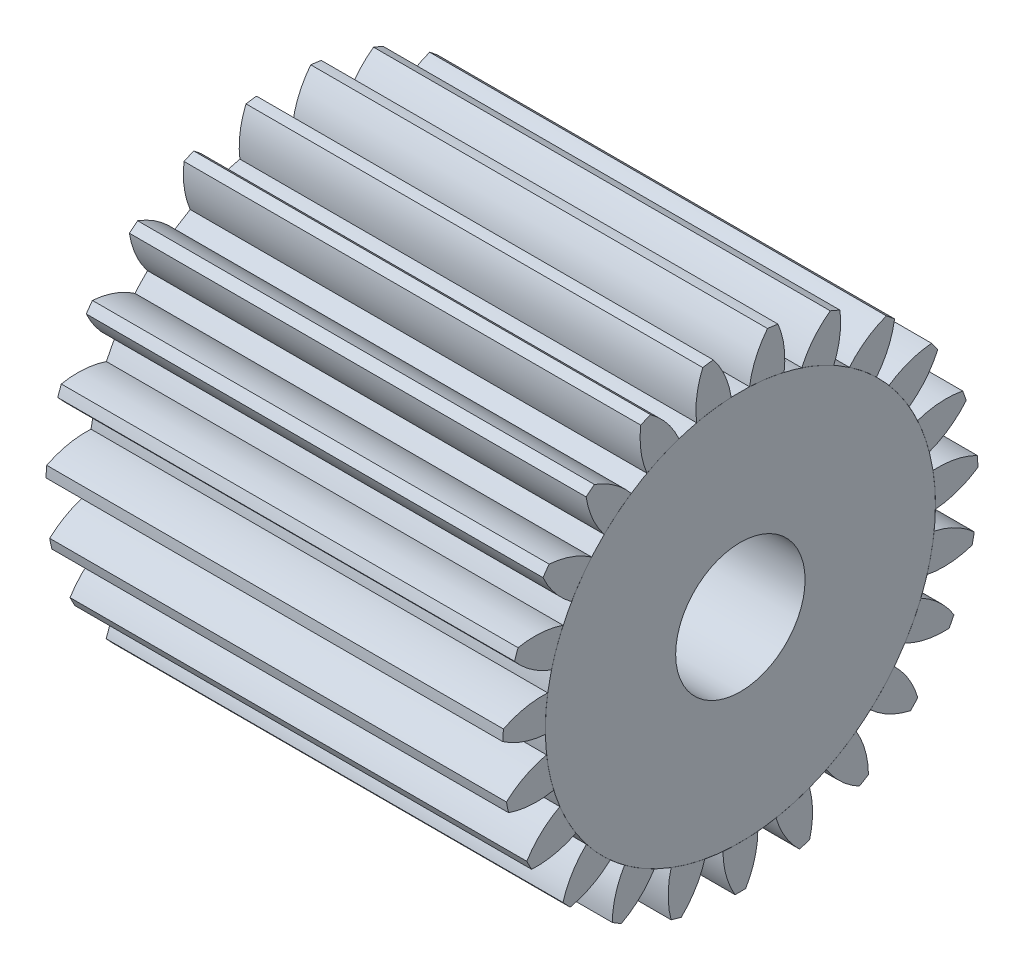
ISO-10303-21;
HEADER;
FILE_DESCRIPTION(('STEP AP214'),'2;1');
FILE_NAME('part.step','',(''),(''),'','','');
FILE_SCHEMA(('AUTOMOTIVE_DESIGN { 1 0 10303 214 1 1 1 1 }'));
ENDSEC;
DATA;
#1=APPLICATION_CONTEXT('core data for automotive mechanical design processes');
#2=APPLICATION_PROTOCOL_DEFINITION('international standard','automotive_design',2000,#1);
#3=PRODUCT_CONTEXT('',#1,'mechanical');
#4=PRODUCT('Part','Part','',(#3));
#5=PRODUCT_RELATED_PRODUCT_CATEGORY('part','',(#4));
#6=PRODUCT_DEFINITION_FORMATION('','',#4);
#7=PRODUCT_DEFINITION_CONTEXT('part definition',#1,'design');
#8=PRODUCT_DEFINITION('design','',#6,#7);
#9=PRODUCT_DEFINITION_SHAPE('','',#8);
#10=(LENGTH_UNIT() NAMED_UNIT(*) SI_UNIT(.MILLI.,.METRE.));
#11=(NAMED_UNIT(*) PLANE_ANGLE_UNIT() SI_UNIT($,.RADIAN.));
#12=(NAMED_UNIT(*) SI_UNIT($,.STERADIAN.) SOLID_ANGLE_UNIT());
#13=UNCERTAINTY_MEASURE_WITH_UNIT(LENGTH_MEASURE(1.E-05),#10,'distance_accuracy_value','');
#14=(GEOMETRIC_REPRESENTATION_CONTEXT(3) GLOBAL_UNCERTAINTY_ASSIGNED_CONTEXT((#13)) GLOBAL_UNIT_ASSIGNED_CONTEXT((#10,
#11,#12)) REPRESENTATION_CONTEXT('',''));
#15=CARTESIAN_POINT('',(0.,0.,0.));
#16=DIRECTION('',(0.,0.,1.));
#17=DIRECTION('',(1.,0.,0.));
#18=AXIS2_PLACEMENT_3D('',#15,#16,#17);
#19=CARTESIAN_POINT('',(-2.53999999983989E-05,0.,0.));
#20=DIRECTION('',(-1.,0.,0.));
#21=DIRECTION('',(0.,0.,1.));
#22=AXIS2_PLACEMENT_3D('',#19,#20,#21);
#23=PLANE('',#22);
#24=CARTESIAN_POINT('',(-2.53999999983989E-05,0.,0.));
#25=DIRECTION('',(-1.,0.,0.));
#26=DIRECTION('',(0.,0.,1.));
#27=AXIS2_PLACEMENT_3D('',#24,#25,#26);
#28=CIRCLE('',#27,25.624);
#29=CARTESIAN_POINT('',(-2.53999999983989E-05,0.,25.624));
#30=VERTEX_POINT('',#29);
#31=EDGE_CURVE('E1310',#30,#30,#28,.T.);
#32=ORIENTED_EDGE('',*,*,#31,.T.);
#33=EDGE_LOOP('',(#32));
#34=FACE_BOUND('',#33,.T.);
#35=CARTESIAN_POINT('',(-2.53999999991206E-05,0.,0.));
#36=DIRECTION('',(-1.,0.,0.));
#37=DIRECTION('',(0.,0.,1.));
#38=AXIS2_PLACEMENT_3D('',#35,#36,#37);
#39=CIRCLE('',#38,8.5);
#40=CARTESIAN_POINT('',(-2.53999999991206E-05,0.,8.5));
#41=VERTEX_POINT('',#40);
#42=EDGE_CURVE('E1308',#41,#41,#39,.F.);
#43=ORIENTED_EDGE('',*,*,#42,.T.);
#44=EDGE_LOOP('',(#43));
#45=FACE_BOUND('',#44,.T.);
#46=ADVANCED_FACE('F30',(#34,#45),#23,.T.);
#47=CARTESIAN_POINT('',(60.0000254,0.,0.));
#48=DIRECTION('',(1.,0.,0.));
#49=DIRECTION('',(0.,0.,-1.));
#50=AXIS2_PLACEMENT_3D('',#47,#48,#49);
#51=PLANE('',#50);
#52=CARTESIAN_POINT('',(60.0000254,0.,0.));
#53=DIRECTION('',(1.,0.,0.));
#54=DIRECTION('',(0.,0.,-1.));
#55=AXIS2_PLACEMENT_3D('',#52,#53,#54);
#56=CIRCLE('',#55,25.624);
#57=CARTESIAN_POINT('',(60.0000254,0.,-25.624));
#58=VERTEX_POINT('',#57);
#59=EDGE_CURVE('E613',#58,#58,#56,.T.);
#60=ORIENTED_EDGE('',*,*,#59,.T.);
#61=EDGE_LOOP('',(#60));
#62=FACE_BOUND('',#61,.T.);
#63=CARTESIAN_POINT('',(60.0000254,0.,0.));
#64=DIRECTION('',(1.,0.,0.));
#65=DIRECTION('',(0.,0.,-1.));
#66=AXIS2_PLACEMENT_3D('',#63,#64,#65);
#67=CIRCLE('',#66,8.5);
#68=CARTESIAN_POINT('',(60.0000254,0.,-8.5));
#69=VERTEX_POINT('',#68);
#70=EDGE_CURVE('E34',#69,#69,#67,.F.);
#71=ORIENTED_EDGE('',*,*,#70,.T.);
#72=EDGE_LOOP('',(#71));
#73=FACE_BOUND('',#72,.T.);
#74=ADVANCED_FACE('F1359',(#62,#73),#51,.T.);
#75=CARTESIAN_POINT('',(60.,0.,0.));
#76=DIRECTION('',(-1.,0.,0.));
#77=DIRECTION('',(0.,0.,1.));
#78=AXIS2_PLACEMENT_3D('',#75,#76,#77);
#79=PLANE('',#78);
#80=CARTESIAN_POINT('',(60.,0.,0.));
#81=DIRECTION('',(1.,0.,0.));
#82=DIRECTION('',(0.,0.,-1.));
#83=AXIS2_PLACEMENT_3D('',#80,#81,#82);
#84=CIRCLE('',#83,25.624);
#85=CARTESIAN_POINT('',(60.,-2.94931867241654,25.4537010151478));
#86=VERTEX_POINT('',#85);
#87=CARTESIAN_POINT('',(60.,-7.43563380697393,24.5214340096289));
#88=VERTEX_POINT('',#87);
#89=EDGE_CURVE('E1618',#86,#88,#84,.T.);
#90=ORIENTED_EDGE('',*,*,#89,.F.);
#91=CARTESIAN_POINT('',(60.,-14.18313209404,22.9937343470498));
#92=DIRECTION('',(-1.,0.,0.));
#93=DIRECTION('',(0.,0.997668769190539,0.0682424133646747));
#94=AXIS2_PLACEMENT_3D('',#91,#92,#93);
#95=CIRCLE('',#94,11.5);
#96=CARTESIAN_POINT('',(60.,-5.67470583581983,30.730444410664));
#97=VERTEX_POINT('',#96);
#98=EDGE_CURVE('E841',#97,#86,#95,.T.);
#99=ORIENTED_EDGE('',*,*,#98,.F.);
#100=CARTESIAN_POINT('',(60.,0.,0.));
#101=DIRECTION('',(-1.,0.,0.));
#102=DIRECTION('',(0.,0.,1.));
#103=AXIS2_PLACEMENT_3D('',#100,#101,#102);
#104=CIRCLE('',#103,31.25);
#105=CARTESIAN_POINT('',(60.,-7.03813821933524,30.4471199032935));
#106=VERTEX_POINT('',#105);
#107=EDGE_CURVE('E1216',#106,#97,#104,.T.);
#108=ORIENTED_EDGE('',*,*,#107,.F.);
#109=CARTESIAN_POINT('',(60.,3.84820022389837,26.7406882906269));
#110=DIRECTION('',(-1.,0.,0.));
#111=DIRECTION('',(0.,0.942260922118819,0.33487961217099));
#112=AXIS2_PLACEMENT_3D('',#109,#110,#111);
#113=CIRCLE('',#112,11.5);
#114=EDGE_CURVE('E821',#88,#106,#113,.T.);
#115=ORIENTED_EDGE('',*,*,#114,.F.);
#116=EDGE_LOOP('',(#90,#99,#108,#115));
#117=FACE_BOUND('',#116,.T.);
#118=ADVANCED_FACE('F32',(#117),#79,.F.);
#119=CARTESIAN_POINT('',(60.,-9.70727628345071,23.7140920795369));
#120=VERTEX_POINT('',#119);
#121=CARTESIAN_POINT('',(60.,-13.7757040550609,21.6060027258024));
#122=VERTEX_POINT('',#121);
#123=EDGE_CURVE('E1620',#120,#122,#84,.T.);
#124=ORIENTED_EDGE('',*,*,#123,.F.);
#125=CARTESIAN_POINT('',(60.,-19.8608183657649,18.3145010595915));
#126=DIRECTION('',(-1.,0.,0.));
#127=DIRECTION('',(0.,0.942260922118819,0.33487961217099));
#128=AXIS2_PLACEMENT_3D('',#125,#126,#127);
#129=CIRCLE('',#128,11.5);
#130=CARTESIAN_POINT('',(60.,-13.7552470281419,28.0598588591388));
#131=VERTEX_POINT('',#130);
#132=EDGE_CURVE('E823',#131,#120,#129,.T.);
#133=ORIENTED_EDGE('',*,*,#132,.F.);
#134=CARTESIAN_POINT('',(60.,-14.9916796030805,27.4191911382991));
#135=VERTEX_POINT('',#134);
#136=EDGE_CURVE('E1221',#135,#131,#104,.T.);
#137=ORIENTED_EDGE('',*,*,#136,.F.);
#138=CARTESIAN_POINT('',(60.,-3.5090528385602,26.7873030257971));
#139=DIRECTION('',(-1.,0.,0.));
#140=DIRECTION('',(0.,0.816969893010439,0.576680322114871));
#141=AXIS2_PLACEMENT_3D('',#138,#139,#140);
#142=CIRCLE('',#141,11.5);
#143=EDGE_CURVE('E803',#122,#135,#142,.T.);
#144=ORIENTED_EDGE('',*,*,#143,.F.);
#145=EDGE_LOOP('',(#124,#133,#137,#144));
#146=FACE_BOUND('',#145,.T.);
#147=ADVANCED_FACE('F2291',(#146),#79,.F.);
#148=CARTESIAN_POINT('',(60.,-15.7452896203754,20.2157174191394));
#149=VERTEX_POINT('',#148);
#150=CARTESIAN_POINT('',(60.,-19.0940933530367,17.0881530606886));
#151=VERTEX_POINT('',#150);
#152=EDGE_CURVE('E1622',#149,#151,#84,.T.);
#153=ORIENTED_EDGE('',*,*,#152,.F.);
#154=CARTESIAN_POINT('',(60.,-24.0655185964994,12.2769650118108));
#155=DIRECTION('',(-1.,0.,0.));
#156=DIRECTION('',(0.,0.816969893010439,0.576680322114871));
#157=AXIS2_PLACEMENT_3D('',#154,#155,#156);
#158=CIRCLE('',#157,11.5);
#159=CARTESIAN_POINT('',(60.,-20.8156244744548,23.3082019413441));
#160=VERTEX_POINT('',#159);
#161=EDGE_CURVE('E805',#160,#149,#158,.T.);
#162=ORIENTED_EDGE('',*,*,#161,.F.);
#163=CARTESIAN_POINT('',(60.,-21.833356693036,22.35770640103));
#164=VERTEX_POINT('',#163);
#165=EDGE_CURVE('E1226',#164,#160,#104,.T.);
#166=ORIENTED_EDGE('',*,*,#165,.F.);
#167=CARTESIAN_POINT('',(60.,-10.6060555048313,24.8472260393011));
#168=DIRECTION('',(-1.,0.,0.));
#169=DIRECTION('',(0.,0.631087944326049,0.775711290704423));
#170=AXIS2_PLACEMENT_3D('',#167,#168,#169);
#171=CIRCLE('',#170,11.5);
#172=EDGE_CURVE('E785',#151,#164,#171,.T.);
#173=ORIENTED_EDGE('',*,*,#172,.F.);
#174=EDGE_LOOP('',(#153,#162,#166,#173));
#175=FACE_BOUND('',#174,.T.);
#176=ADVANCED_FACE('F2283',(#175),#79,.F.);
#177=CARTESIAN_POINT('',(60.,-20.615546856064,15.2180354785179));
#178=VERTEX_POINT('',#177);
#179=CARTESIAN_POINT('',(60.,-22.9963610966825,11.3029532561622));
#180=VERTEX_POINT('',#179);
#181=EDGE_CURVE('E1624',#178,#180,#84,.T.);
#182=ORIENTED_EDGE('',*,*,#181,.F.);
#183=CARTESIAN_POINT('',(60.,-26.4853894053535,5.3289026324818));
#184=DIRECTION('',(-1.,0.,0.));
#185=DIRECTION('',(0.,0.631087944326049,0.775711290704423));
#186=AXIS2_PLACEMENT_3D('',#183,#184,#185);
#187=CIRCLE('',#186,11.5);
#188=CARTESIAN_POINT('',(60.,-26.332202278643,16.8278823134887));
#189=VERTEX_POINT('',#188);
#190=EDGE_CURVE('E787',#189,#178,#187,.T.);
#191=ORIENTED_EDGE('',*,*,#190,.F.);
#192=CARTESIAN_POINT('',(60.,-27.0557535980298,15.6380528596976));
#193=VERTEX_POINT('',#192);
#194=EDGE_CURVE('E1231',#193,#189,#104,.T.);
#195=ORIENTED_EDGE('',*,*,#194,.F.);
#196=CARTESIAN_POINT('',(60.,-16.9164555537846,21.0643439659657));
#197=DIRECTION('',(-1.,0.,0.));
#198=DIRECTION('',(0.,0.398401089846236,0.917211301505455));
#199=AXIS2_PLACEMENT_3D('',#196,#197,#198);
#200=CIRCLE('',#199,11.5);
#201=EDGE_CURVE('E767',#180,#193,#200,.T.);
#202=ORIENTED_EDGE('',*,*,#201,.F.);
#203=EDGE_LOOP('',(#182,#191,#195,#202));
#204=FACE_BOUND('',#203,.T.);
#205=ADVANCED_FACE('F2275',(#204),#79,.F.);
#206=CARTESIAN_POINT('',(60.,-23.9568432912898,9.09170146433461));
#207=VERTEX_POINT('',#206);
#208=CARTESIAN_POINT('',(60.,-25.1930939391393,4.67946511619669));
#209=VERTEX_POINT('',#208);
#210=EDGE_CURVE('E1626',#207,#209,#84,.T.);
#211=ORIENTED_EDGE('',*,*,#210,.F.);
#212=CARTESIAN_POINT('',(60.,-26.9409600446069,-2.01438007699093));
#213=DIRECTION('',(-1.,0.,0.));
#214=DIRECTION('',(0.,0.398401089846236,0.917211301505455));
#215=AXIS2_PLACEMENT_3D('',#212,#213,#214);
#216=CIRCLE('',#215,11.5);
#217=CARTESIAN_POINT('',(60.,-29.8958411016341,9.09951563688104));
#218=VERTEX_POINT('',#217);
#219=EDGE_CURVE('E769',#218,#207,#216,.T.);
#220=ORIENTED_EDGE('',*,*,#219,.F.);
#221=CARTESIAN_POINT('',(60.,-30.2715490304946,7.758596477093));
#222=VERTEX_POINT('',#221);
#223=EDGE_CURVE('E1236',#222,#218,#104,.T.);
#224=ORIENTED_EDGE('',*,*,#223,.F.);
#225=CARTESIAN_POINT('',(60.,-21.9722394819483,15.7192158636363));
#226=DIRECTION('',(-1.,0.,0.));
#227=DIRECTION('',(0.,0.13616664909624,0.990685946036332));
#228=AXIS2_PLACEMENT_3D('',#225,#226,#227);
#229=CIRCLE('',#228,11.5);
#230=EDGE_CURVE('E749',#209,#222,#229,.T.);
#231=ORIENTED_EDGE('',*,*,#230,.F.);
#232=EDGE_LOOP('',(#211,#220,#224,#231));
#233=FACE_BOUND('',#232,.T.);
#234=ADVANCED_FACE('F2267',(#233),#79,.F.);
#235=CARTESIAN_POINT('',(60.,-25.5213702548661,2.29107754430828));
#236=VERTEX_POINT('',#235);
#237=CARTESIAN_POINT('',(60.,-25.5213702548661,-2.29107754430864));
#238=VERTEX_POINT('',#237);
#239=EDGE_CURVE('E1628',#236,#238,#84,.T.);
#240=ORIENTED_EDGE('',*,*,#239,.F.);
#241=CARTESIAN_POINT('',(60.,-25.3984429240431,-9.20826543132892));
#242=DIRECTION('',(-1.,0.,0.));
#243=DIRECTION('',(0.,0.13616664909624,0.990685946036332));
#244=AXIS2_PLACEMENT_3D('',#241,#242,#243);
#245=CIRCLE('',#244,11.5);
#246=CARTESIAN_POINT('',(60.,-31.2422421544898,0.696279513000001));
#247=VERTEX_POINT('',#246);
#248=EDGE_CURVE('E751',#247,#236,#245,.T.);
#249=ORIENTED_EDGE('',*,*,#248,.F.);
#250=CARTESIAN_POINT('',(60.,-31.2422421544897,-0.696279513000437));
#251=VERTEX_POINT('',#250);
#252=EDGE_CURVE('E1241',#251,#247,#104,.T.);
#253=ORIENTED_EDGE('',*,*,#252,.F.);
#254=CARTESIAN_POINT('',(60.,-25.3984429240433,9.20826543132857));
#255=DIRECTION('',(-1.,0.,0.));
#256=DIRECTION('',(0.,-0.136166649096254,0.99068594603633));
#257=AXIS2_PLACEMENT_3D('',#254,#255,#256);
#258=CIRCLE('',#257,11.5);
#259=EDGE_CURVE('E731',#238,#251,#258,.T.);
#260=ORIENTED_EDGE('',*,*,#259,.F.);
#261=EDGE_LOOP('',(#240,#249,#253,#260));
#262=FACE_BOUND('',#261,.T.);
#263=ADVANCED_FACE('F2259',(#262),#79,.F.);
#264=CARTESIAN_POINT('',(60.,-25.1930939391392,-4.67946511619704));
#265=VERTEX_POINT('',#264);
#266=CARTESIAN_POINT('',(60.,-23.9568432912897,-9.09170146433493));
#267=VERTEX_POINT('',#266);
#268=EDGE_CURVE('E1630',#265,#267,#84,.T.);
#269=ORIENTED_EDGE('',*,*,#268,.F.);
#270=CARTESIAN_POINT('',(60.,-21.9722394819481,-15.7192158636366));
#271=DIRECTION('',(-1.,0.,0.));
#272=DIRECTION('',(0.,-0.136166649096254,0.99068594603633));
#273=AXIS2_PLACEMENT_3D('',#270,#271,#272);
#274=CIRCLE('',#273,11.5);
#275=CARTESIAN_POINT('',(60.,-30.2715490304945,-7.75859647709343));
#276=VERTEX_POINT('',#275);
#277=EDGE_CURVE('E733',#276,#265,#274,.T.);
#278=ORIENTED_EDGE('',*,*,#277,.F.);
#279=CARTESIAN_POINT('',(60.,-29.895841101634,-9.09951563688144));
#280=VERTEX_POINT('',#279);
#281=EDGE_CURVE('E1246',#280,#276,#104,.T.);
#282=ORIENTED_EDGE('',*,*,#281,.F.);
#283=CARTESIAN_POINT('',(60.,-26.9409600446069,2.01438007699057));
#284=DIRECTION('',(-1.,0.,0.));
#285=DIRECTION('',(0.,-0.398401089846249,0.91721130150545));
#286=AXIS2_PLACEMENT_3D('',#283,#284,#285);
#287=CIRCLE('',#286,11.5);
#288=EDGE_CURVE('E713',#267,#280,#287,.T.);
#289=ORIENTED_EDGE('',*,*,#288,.F.);
#290=EDGE_LOOP('',(#269,#278,#282,#289));
#291=FACE_BOUND('',#290,.T.);
#292=ADVANCED_FACE('F2251',(#291),#79,.F.);
#293=CARTESIAN_POINT('',(60.,-22.9963610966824,-11.3029532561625));
#294=VERTEX_POINT('',#293);
#295=CARTESIAN_POINT('',(60.,-20.6155468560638,-15.2180354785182));
#296=VERTEX_POINT('',#295);
#297=EDGE_CURVE('E1632',#294,#296,#84,.T.);
#298=ORIENTED_EDGE('',*,*,#297,.F.);
#299=CARTESIAN_POINT('',(60.,-16.9164555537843,-21.0643439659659));
#300=DIRECTION('',(-1.,0.,0.));
#301=DIRECTION('',(0.,-0.398401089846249,0.91721130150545));
#302=AXIS2_PLACEMENT_3D('',#299,#300,#301);
#303=CIRCLE('',#302,11.5);
#304=CARTESIAN_POINT('',(60.,-27.0557535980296,-15.638052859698));
#305=VERTEX_POINT('',#304);
#306=EDGE_CURVE('E715',#305,#294,#303,.T.);
#307=ORIENTED_EDGE('',*,*,#306,.F.);
#308=CARTESIAN_POINT('',(60.,-26.3322022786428,-16.8278823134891));
#309=VERTEX_POINT('',#308);
#310=EDGE_CURVE('E1251',#309,#305,#104,.T.);
#311=ORIENTED_EDGE('',*,*,#310,.F.);
#312=CARTESIAN_POINT('',(60.,-26.4853894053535,-5.32890263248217));
#313=DIRECTION('',(-1.,0.,0.));
#314=DIRECTION('',(0.,-0.631087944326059,0.775711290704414));
#315=AXIS2_PLACEMENT_3D('',#312,#313,#314);
#316=CIRCLE('',#315,11.5);
#317=EDGE_CURVE('E695',#296,#309,#316,.T.);
#318=ORIENTED_EDGE('',*,*,#317,.F.);
#319=EDGE_LOOP('',(#298,#307,#311,#318));
#320=FACE_BOUND('',#319,.T.);
#321=ADVANCED_FACE('F2243',(#320),#79,.F.);
#322=CARTESIAN_POINT('',(60.,-19.0940933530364,-17.0881530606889));
#323=VERTEX_POINT('',#322);
#324=CARTESIAN_POINT('',(60.,-15.7452896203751,-20.2157174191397));
#325=VERTEX_POINT('',#324);
#326=EDGE_CURVE('E1634',#323,#325,#84,.T.);
#327=ORIENTED_EDGE('',*,*,#326,.F.);
#328=CARTESIAN_POINT('',(60.,-10.606055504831,-24.8472260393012));
#329=DIRECTION('',(-1.,0.,0.));
#330=DIRECTION('',(0.,-0.631087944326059,0.775711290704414));
#331=AXIS2_PLACEMENT_3D('',#328,#329,#330);
#332=CIRCLE('',#331,11.5);
#333=CARTESIAN_POINT('',(60.,-21.8333566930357,-22.3577064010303));
#334=VERTEX_POINT('',#333);
#335=EDGE_CURVE('E697',#334,#323,#332,.T.);
#336=ORIENTED_EDGE('',*,*,#335,.F.);
#337=CARTESIAN_POINT('',(60.,-20.8156244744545,-23.3082019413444));
#338=VERTEX_POINT('',#337);
#339=EDGE_CURVE('E1256',#338,#334,#104,.T.);
#340=ORIENTED_EDGE('',*,*,#339,.F.);
#341=CARTESIAN_POINT('',(60.,-24.0655185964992,-12.2769650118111));
#342=DIRECTION('',(-1.,0.,0.));
#343=DIRECTION('',(0.,-0.816969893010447,0.57668032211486));
#344=AXIS2_PLACEMENT_3D('',#341,#342,#343);
#345=CIRCLE('',#344,11.5);
#346=EDGE_CURVE('E677',#325,#338,#345,.T.);
#347=ORIENTED_EDGE('',*,*,#346,.F.);
#348=EDGE_LOOP('',(#327,#336,#340,#347));
#349=FACE_BOUND('',#348,.T.);
#350=ADVANCED_FACE('F2235',(#349),#79,.F.);
#351=CARTESIAN_POINT('',(60.,-13.7757040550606,-21.6060027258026));
#352=VERTEX_POINT('',#351);
#353=CARTESIAN_POINT('',(60.,-9.70727628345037,-23.714092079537));
#354=VERTEX_POINT('',#353);
#355=EDGE_CURVE('E1636',#352,#354,#84,.T.);
#356=ORIENTED_EDGE('',*,*,#355,.F.);
#357=CARTESIAN_POINT('',(60.,-3.50905283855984,-26.7873030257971));
#358=DIRECTION('',(-1.,0.,0.));
#359=DIRECTION('',(0.,-0.816969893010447,0.57668032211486));
#360=AXIS2_PLACEMENT_3D('',#357,#358,#359);
#361=CIRCLE('',#360,11.5);
#362=CARTESIAN_POINT('',(60.,-14.9916796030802,-27.4191911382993));
#363=VERTEX_POINT('',#362);
#364=EDGE_CURVE('E679',#363,#352,#361,.T.);
#365=ORIENTED_EDGE('',*,*,#364,.F.);
#366=CARTESIAN_POINT('',(60.,-13.7552470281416,-28.059858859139));
#367=VERTEX_POINT('',#366);
#368=EDGE_CURVE('E1261',#367,#363,#104,.T.);
#369=ORIENTED_EDGE('',*,*,#368,.F.);
#370=CARTESIAN_POINT('',(60.,-19.8608183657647,-18.3145010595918));
#371=DIRECTION('',(-1.,0.,0.));
#372=DIRECTION('',(0.,-0.942260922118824,0.334879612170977));
#373=AXIS2_PLACEMENT_3D('',#370,#371,#372);
#374=CIRCLE('',#373,11.5);
#375=EDGE_CURVE('E659',#354,#367,#374,.T.);
#376=ORIENTED_EDGE('',*,*,#375,.F.);
#377=EDGE_LOOP('',(#356,#365,#369,#376));
#378=FACE_BOUND('',#377,.T.);
#379=ADVANCED_FACE('F2228',(#378),#79,.F.);
#380=CARTESIAN_POINT('',(60.,-7.4356338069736,-24.521434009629));
#381=VERTEX_POINT('',#380);
#382=CARTESIAN_POINT('',(60.,-2.94931867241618,-25.4537010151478));
#383=VERTEX_POINT('',#382);
#384=EDGE_CURVE('E1307',#381,#383,#84,.T.);
#385=ORIENTED_EDGE('',*,*,#384,.F.);
#386=CARTESIAN_POINT('',(60.,3.84820022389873,-26.7406882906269));
#387=DIRECTION('',(-1.,0.,0.));
#388=DIRECTION('',(0.,-0.942260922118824,0.334879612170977));
#389=AXIS2_PLACEMENT_3D('',#386,#387,#388);
#390=CIRCLE('',#389,11.5);
#391=CARTESIAN_POINT('',(60.,-7.03813821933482,-30.4471199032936));
#392=VERTEX_POINT('',#391);
#393=EDGE_CURVE('E661',#392,#381,#390,.T.);
#394=ORIENTED_EDGE('',*,*,#393,.F.);
#395=CARTESIAN_POINT('',(60.,-5.6747058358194,-30.7304444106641));
#396=VERTEX_POINT('',#395);
#397=EDGE_CURVE('E1266',#396,#392,#104,.T.);
#398=ORIENTED_EDGE('',*,*,#397,.F.);
#399=CARTESIAN_POINT('',(60.,-14.1831320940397,-22.99373434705));
#400=DIRECTION('',(-1.,0.,0.));
#401=DIRECTION('',(0.,-0.99766876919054,0.0682424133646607));
#402=AXIS2_PLACEMENT_3D('',#399,#400,#401);
#403=CIRCLE('',#402,11.5);
#404=EDGE_CURVE('E641',#383,#396,#403,.T.);
#405=ORIENTED_EDGE('',*,*,#404,.F.);
#406=EDGE_LOOP('',(#385,#394,#398,#405));
#407=FACE_BOUND('',#406,.T.);
#408=ADVANCED_FACE('F1644',(#407),#79,.F.);
#409=CARTESIAN_POINT('',(60.,-0.544096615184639,-25.6182227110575));
#410=VERTEX_POINT('',#409);
#411=CARTESIAN_POINT('',(60.,4.02737641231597,-25.3055253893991));
#412=VERTEX_POINT('',#411);
#413=EDGE_CURVE('E616',#410,#412,#84,.T.);
#414=ORIENTED_EDGE('',*,*,#413,.F.);
#415=CARTESIAN_POINT('',(60.,10.9200498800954,-24.7108390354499));
#416=DIRECTION('',(-1.,0.,0.));
#417=DIRECTION('',(0.,-0.99766876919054,0.0682424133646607));
#418=AXIS2_PLACEMENT_3D('',#415,#416,#417);
#419=CIRCLE('',#418,11.5);
#420=CARTESIAN_POINT('',(60.,1.43738967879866,-31.2169250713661));
#421=VERTEX_POINT('',#420);
#422=EDGE_CURVE('E643',#421,#410,#419,.T.);
#423=ORIENTED_EDGE('',*,*,#422,.F.);
#424=CARTESIAN_POINT('',(60.,2.82670232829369,-31.121893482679));
#425=VERTEX_POINT('',#424);
#426=EDGE_CURVE('E1271',#425,#421,#104,.T.);
#427=ORIENTED_EDGE('',*,*,#426,.F.);
#428=CARTESIAN_POINT('',(60.,-7.4535477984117,-25.9676275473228));
#429=DIRECTION('',(-1.,0.,0.));
#430=DIRECTION('',(0.,-0.979084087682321,-0.203456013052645));
#431=AXIS2_PLACEMENT_3D('',#428,#429,#430);
#432=CIRCLE('',#431,11.5);
#433=EDGE_CURVE('E626',#412,#425,#432,.T.);
#434=ORIENTED_EDGE('',*,*,#433,.F.);
#435=EDGE_LOOP('',(#414,#423,#427,#434));
#436=FACE_BOUND('',#435,.T.);
#437=ADVANCED_FACE('F2214',(#436),#79,.F.);
#438=CARTESIAN_POINT('',(60.,6.38779373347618,-24.8150250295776));
#439=VERTEX_POINT('',#438);
#440=CARTESIAN_POINT('',(60.,10.7053794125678,-23.2805547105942));
#441=VERTEX_POINT('',#440);
#442=EDGE_CURVE('E603',#439,#441,#84,.T.);
#443=ORIENTED_EDGE('',*,*,#442,.F.);
#444=CARTESIAN_POINT('',(60.,17.1820093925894,-20.8482998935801));
#445=DIRECTION('',(-1.,0.,0.));
#446=DIRECTION('',(0.,-0.979084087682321,-0.203456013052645));
#447=AXIS2_PLACEMENT_3D('',#444,#445,#446);
#448=CIRCLE('',#447,11.5);
#449=CARTESIAN_POINT('',(60.,9.80631296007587,-29.671513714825));
#450=VERTEX_POINT('',#449);
#451=EDGE_CURVE('E607',#450,#439,#448,.T.);
#452=ORIENTED_EDGE('',*,*,#451,.F.);
#453=CARTESIAN_POINT('',(60.,11.1184669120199,-29.2051740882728));
#454=VERTEX_POINT('',#453);
#455=EDGE_CURVE('E1276',#454,#450,#104,.T.);
#456=ORIENTED_EDGE('',*,*,#455,.F.);
#457=CARTESIAN_POINT('',(60.,-0.171167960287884,-27.0156206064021));
#458=DIRECTION('',(-1.,0.,0.));
#459=DIRECTION('',(0.,-0.88788521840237,-0.460065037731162));
#460=AXIS2_PLACEMENT_3D('',#457,#458,#459);
#461=CIRCLE('',#460,11.5);
#462=EDGE_CURVE('E608',#441,#454,#461,.T.);
#463=ORIENTED_EDGE('',*,*,#462,.F.);
#464=EDGE_LOOP('',(#443,#452,#456,#463));
#465=FACE_BOUND('',#464,.T.);
#466=ADVANCED_FACE('F605',(#465),#79,.F.);
#467=CARTESIAN_POINT('',(60.,12.8459306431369,-22.1714104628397));
#468=VERTEX_POINT('',#467);
#469=CARTESIAN_POINT('',(60.,16.5894133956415,-19.5289717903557));
#470=VERTEX_POINT('',#469);
#471=EDGE_CURVE('E614',#468,#470,#84,.T.);
#472=ORIENTED_EDGE('',*,*,#471,.F.);
#473=CARTESIAN_POINT('',(60.,22.1696578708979,-15.4395377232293));
#474=DIRECTION('',(-1.,0.,0.));
#475=DIRECTION('',(0.,-0.88788521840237,-0.460065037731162));
#476=AXIS2_PLACEMENT_3D('',#473,#474,#475);
#477=CIRCLE('',#476,11.5);
#478=CARTESIAN_POINT('',(60.,17.447946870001,-25.9255019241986));
#479=VERTEX_POINT('',#478);
#480=EDGE_CURVE('E1081',#479,#468,#477,.T.);
#481=ORIENTED_EDGE('',*,*,#480,.F.);
#482=CARTESIAN_POINT('',(60.,18.5856256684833,-25.1224405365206));
#483=VERTEX_POINT('',#482);
#484=EDGE_CURVE('E1277',#483,#479,#104,.T.);
#485=ORIENTED_EDGE('',*,*,#484,.F.);
#486=CARTESIAN_POINT('',(60.,7.1239066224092,-26.0599886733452));
#487=DIRECTION('',(-1.,0.,0.));
#488=DIRECTION('',(0.,-0.730835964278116,-0.682553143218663));
#489=AXIS2_PLACEMENT_3D('',#486,#487,#488);
#490=CIRCLE('',#489,11.5);
#491=EDGE_CURVE('E1063',#470,#483,#490,.T.);
#492=ORIENTED_EDGE('',*,*,#491,.F.);
#493=EDGE_LOOP('',(#472,#481,#485,#492));
#494=FACE_BOUND('',#493,.T.);
#495=ADVANCED_FACE('F2200',(#494),#79,.F.);
#496=CARTESIAN_POINT('',(60.,18.3513436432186,-17.8834438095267));
#497=VERTEX_POINT('',#496);
#498=CARTESIAN_POINT('',(60.,21.243086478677,-14.3290143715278));
#499=VERTEX_POINT('',#498);
#500=EDGE_CURVE('E1298',#497,#499,#84,.T.);
#501=ORIENTED_EDGE('',*,*,#500,.F.);
#502=CARTESIAN_POINT('',(60.,25.5130842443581,-8.88569567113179));
#503=DIRECTION('',(-1.,0.,0.));
#504=DIRECTION('',(0.,-0.730835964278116,-0.682553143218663));
#505=AXIS2_PLACEMENT_3D('',#502,#503,#504);
#506=CIRCLE('',#505,11.5);
#507=CARTESIAN_POINT('',(60.,23.7955463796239,-20.2567142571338));
#508=VERTEX_POINT('',#507);
#509=EDGE_CURVE('E1065',#508,#497,#506,.T.);
#510=ORIENTED_EDGE('',*,*,#509,.F.);
#511=CARTESIAN_POINT('',(60.,24.6743735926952,-19.1764904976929));
#512=VERTEX_POINT('',#511);
#513=EDGE_CURVE('E1280',#512,#508,#104,.T.);
#514=ORIENTED_EDGE('',*,*,#513,.F.);
#515=CARTESIAN_POINT('',(60.,13.8906336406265,-23.1716065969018));
#516=DIRECTION('',(-1.,0.,0.));
#517=DIRECTION('',(0.,-0.519583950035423,-0.854419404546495));
#518=AXIS2_PLACEMENT_3D('',#515,#516,#517);
#519=CIRCLE('',#518,11.5);
#520=EDGE_CURVE('E1299',#499,#512,#519,.T.);
#521=ORIENTED_EDGE('',*,*,#520,.F.);
#522=EDGE_LOOP('',(#501,#510,#514,#521));
#523=FACE_BOUND('',#522,.T.);
#524=ADVANCED_FACE('F1297',(#523),#79,.F.);
#525=CARTESIAN_POINT('',(60.,22.4957214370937,-12.2691439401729));
#526=VERTEX_POINT('',#525);
#527=CARTESIAN_POINT('',(60.,24.3212570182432,-8.06633950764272));
#528=VERTEX_POINT('',#527);
#529=EDGE_CURVE('E1303',#526,#528,#84,.T.);
#530=ORIENTED_EDGE('',*,*,#529,.F.);
#531=CARTESIAN_POINT('',(60.,26.9643218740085,-1.67284222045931));
#532=DIRECTION('',(-1.,0.,0.));
#533=DIRECTION('',(0.,-0.519583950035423,-0.854419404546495));
#534=AXIS2_PLACEMENT_3D('',#531,#532,#533);
#535=CIRCLE('',#534,11.5);
#536=CARTESIAN_POINT('',(60.,28.3783390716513,-13.0855787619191));
#537=VERTEX_POINT('',#536);
#538=EDGE_CURVE('E1336',#537,#526,#535,.T.);
#539=ORIENTED_EDGE('',*,*,#538,.F.);
#540=CARTESIAN_POINT('',(60.,28.9331361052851,-11.808307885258));
#541=VERTEX_POINT('',#540);
#542=EDGE_CURVE('E974',#541,#537,#104,.T.);
#543=ORIENTED_EDGE('',*,*,#542,.F.);
#544=CARTESIAN_POINT('',(60.,19.627155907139,-18.5646924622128));
#545=DIRECTION('',(-1.,0.,0.));
#546=DIRECTION('',(0.,-0.269796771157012,-0.962917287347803));
#547=AXIS2_PLACEMENT_3D('',#544,#545,#546);
#548=CIRCLE('',#547,11.5);
#549=EDGE_CURVE('E1319',#528,#541,#548,.T.);
#550=ORIENTED_EDGE('',*,*,#549,.F.);
#551=EDGE_LOOP('',(#530,#539,#543,#550));
#552=FACE_BOUND('',#551,.T.);
#553=ADVANCED_FACE('F2185',(#552),#79,.F.);
#554=CARTESIAN_POINT('',(60.,24.9716944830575,-5.74489779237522));
#555=VERTEX_POINT('',#554);
#556=CARTESIAN_POINT('',(60.,25.5956311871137,-1.20542114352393));
#557=VERTEX_POINT('',#556);
#558=EDGE_CURVE('E1304',#555,#557,#84,.T.);
#559=ORIENTED_EDGE('',*,*,#558,.F.);
#560=CARTESIAN_POINT('',(60.,26.4157391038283,5.66407828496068));
#561=DIRECTION('',(-1.,0.,0.));
#562=DIRECTION('',(0.,-0.269796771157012,-0.962917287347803));
#563=AXIS2_PLACEMENT_3D('',#560,#561,#562);
#564=CIRCLE('',#563,11.5);
#565=CARTESIAN_POINT('',(60.,30.8564401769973,-4.94394575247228));
#566=VERTEX_POINT('',#565);
#567=EDGE_CURVE('E1321',#566,#555,#564,.T.);
#568=ORIENTED_EDGE('',*,*,#567,.F.);
#569=CARTESIAN_POINT('',(60.,31.0460602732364,-3.56435709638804));
#570=VERTEX_POINT('',#569);
#571=EDGE_CURVE('E970',#570,#566,#104,.T.);
#572=ORIENTED_EDGE('',*,*,#571,.F.);
#573=CARTESIAN_POINT('',(60.,23.9080218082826,-12.5809200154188));
#574=DIRECTION('',(-1.,0.,0.));
#575=DIRECTION('',(0.,0.,-1.));
#576=AXIS2_PLACEMENT_3D('',#573,#574,#575);
#577=CIRCLE('',#576,11.5);
#578=EDGE_CURVE('E947',#557,#570,#577,.T.);
#579=ORIENTED_EDGE('',*,*,#578,.F.);
#580=EDGE_LOOP('',(#559,#568,#572,#579));
#581=FACE_BOUND('',#580,.T.);
#582=ADVANCED_FACE('F2178',(#581),#79,.F.);
#583=CARTESIAN_POINT('',(60.,25.5956311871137,1.20542114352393));
#584=VERTEX_POINT('',#583);
#585=CARTESIAN_POINT('',(60.,24.9716944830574,5.74489779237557));
#586=VERTEX_POINT('',#585);
#587=EDGE_CURVE('E2567',#584,#586,#84,.T.);
#588=ORIENTED_EDGE('',*,*,#587,.F.);
#589=CARTESIAN_POINT('',(60.,23.9080218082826,12.5809200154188));
#590=DIRECTION('',(-1.,0.,0.));
#591=DIRECTION('',(0.,0.,-1.));
#592=AXIS2_PLACEMENT_3D('',#589,#590,#591);
#593=CIRCLE('',#592,11.5);
#594=CARTESIAN_POINT('',(60.,31.0460602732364,3.56435709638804));
#595=VERTEX_POINT('',#594);
#596=EDGE_CURVE('E949',#595,#584,#593,.T.);
#597=ORIENTED_EDGE('',*,*,#596,.F.);
#598=CARTESIAN_POINT('',(60.,30.8564401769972,4.94394575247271));
#599=VERTEX_POINT('',#598);
#600=EDGE_CURVE('E968',#599,#595,#104,.T.);
#601=ORIENTED_EDGE('',*,*,#600,.F.);
#602=CARTESIAN_POINT('',(60.,26.4157391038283,-5.66407828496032));
#603=DIRECTION('',(-1.,0.,0.));
#604=DIRECTION('',(0.,0.269796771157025,-0.962917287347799));
#605=AXIS2_PLACEMENT_3D('',#602,#603,#604);
#606=CIRCLE('',#605,11.5);
#607=EDGE_CURVE('E929',#586,#599,#606,.T.);
#608=ORIENTED_EDGE('',*,*,#607,.F.);
#609=EDGE_LOOP('',(#588,#597,#601,#608));
#610=FACE_BOUND('',#609,.T.);
#611=ADVANCED_FACE('F2170',(#610),#79,.F.);
#612=CARTESIAN_POINT('',(60.,24.321257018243,8.06633950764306));
#613=VERTEX_POINT('',#612);
#614=CARTESIAN_POINT('',(60.,22.4957214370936,12.2691439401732));
#615=VERTEX_POINT('',#614);
#616=EDGE_CURVE('E2564',#613,#615,#84,.T.);
#617=ORIENTED_EDGE('',*,*,#616,.F.);
#618=CARTESIAN_POINT('',(60.,19.6271559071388,18.5646924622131));
#619=DIRECTION('',(-1.,0.,0.));
#620=DIRECTION('',(0.,0.269796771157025,-0.962917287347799));
#621=AXIS2_PLACEMENT_3D('',#618,#619,#620);
#622=CIRCLE('',#621,11.5);
#623=CARTESIAN_POINT('',(60.,28.933136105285,11.8083078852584));
#624=VERTEX_POINT('',#623);
#625=EDGE_CURVE('E931',#624,#613,#622,.T.);
#626=ORIENTED_EDGE('',*,*,#625,.F.);
#627=CARTESIAN_POINT('',(60.,28.3783390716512,13.0855787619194));
#628=VERTEX_POINT('',#627);
#629=EDGE_CURVE('E1195',#628,#624,#104,.T.);
#630=ORIENTED_EDGE('',*,*,#629,.F.);
#631=CARTESIAN_POINT('',(60.,26.9643218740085,1.67284222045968));
#632=DIRECTION('',(-1.,0.,0.));
#633=DIRECTION('',(0.,0.519583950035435,-0.854419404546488));
#634=AXIS2_PLACEMENT_3D('',#631,#632,#633);
#635=CIRCLE('',#634,11.5);
#636=EDGE_CURVE('E911',#615,#628,#635,.T.);
#637=ORIENTED_EDGE('',*,*,#636,.F.);
#638=EDGE_LOOP('',(#617,#626,#630,#637));
#639=FACE_BOUND('',#638,.T.);
#640=ADVANCED_FACE('F2162',(#639),#79,.F.);
#641=CARTESIAN_POINT('',(60.,21.2430864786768,14.3290143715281));
#642=VERTEX_POINT('',#641);
#643=CARTESIAN_POINT('',(60.,18.3513436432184,17.883443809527));
#644=VERTEX_POINT('',#643);
#645=EDGE_CURVE('E2560',#642,#644,#84,.T.);
#646=ORIENTED_EDGE('',*,*,#645,.F.);
#647=CARTESIAN_POINT('',(60.,13.8906336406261,23.1716065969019));
#648=DIRECTION('',(-1.,0.,0.));
#649=DIRECTION('',(0.,0.519583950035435,-0.854419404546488));
#650=AXIS2_PLACEMENT_3D('',#647,#648,#649);
#651=CIRCLE('',#650,11.5);
#652=CARTESIAN_POINT('',(60.,24.6743735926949,19.1764904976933));
#653=VERTEX_POINT('',#652);
#654=EDGE_CURVE('E913',#653,#642,#651,.T.);
#655=ORIENTED_EDGE('',*,*,#654,.F.);
#656=CARTESIAN_POINT('',(60.,23.7955463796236,20.2567142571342));
#657=VERTEX_POINT('',#656);
#658=EDGE_CURVE('E1196',#657,#653,#104,.T.);
#659=ORIENTED_EDGE('',*,*,#658,.F.);
#660=CARTESIAN_POINT('',(60.,25.513084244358,8.88569567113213));
#661=DIRECTION('',(-1.,0.,0.));
#662=DIRECTION('',(0.,0.730835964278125,-0.682553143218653));
#663=AXIS2_PLACEMENT_3D('',#660,#661,#662);
#664=CIRCLE('',#663,11.5);
#665=EDGE_CURVE('E893',#644,#657,#664,.T.);
#666=ORIENTED_EDGE('',*,*,#665,.F.);
#667=EDGE_LOOP('',(#646,#655,#659,#666));
#668=FACE_BOUND('',#667,.T.);
#669=ADVANCED_FACE('F2154',(#668),#79,.F.);
#670=CARTESIAN_POINT('',(60.,16.5894133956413,19.528971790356));
#671=VERTEX_POINT('',#670);
#672=CARTESIAN_POINT('',(60.,12.8459306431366,22.1714104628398));
#673=VERTEX_POINT('',#672);
#674=EDGE_CURVE('E2556',#671,#673,#84,.T.);
#675=ORIENTED_EDGE('',*,*,#674,.F.);
#676=CARTESIAN_POINT('',(60.,7.12390662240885,26.0599886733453));
#677=DIRECTION('',(-1.,0.,0.));
#678=DIRECTION('',(0.,0.730835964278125,-0.682553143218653));
#679=AXIS2_PLACEMENT_3D('',#676,#677,#678);
#680=CIRCLE('',#679,11.5);
#681=CARTESIAN_POINT('',(60.,18.5856256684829,25.1224405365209));
#682=VERTEX_POINT('',#681);
#683=EDGE_CURVE('E895',#682,#671,#680,.T.);
#684=ORIENTED_EDGE('',*,*,#683,.F.);
#685=CARTESIAN_POINT('',(60.,17.4479468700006,25.9255019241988));
#686=VERTEX_POINT('',#685);
#687=EDGE_CURVE('E1201',#686,#682,#104,.T.);
#688=ORIENTED_EDGE('',*,*,#687,.F.);
#689=CARTESIAN_POINT('',(60.,22.1696578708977,15.4395377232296));
#690=DIRECTION('',(-1.,0.,0.));
#691=DIRECTION('',(0.,0.887885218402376,-0.46006503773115));
#692=AXIS2_PLACEMENT_3D('',#689,#690,#691);
#693=CIRCLE('',#692,11.5);
#694=EDGE_CURVE('E875',#673,#686,#693,.T.);
#695=ORIENTED_EDGE('',*,*,#694,.F.);
#696=EDGE_LOOP('',(#675,#684,#688,#695));
#697=FACE_BOUND('',#696,.T.);
#698=ADVANCED_FACE('F2146',(#697),#79,.F.);
#699=CARTESIAN_POINT('',(60.,10.7053794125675,23.2805547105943));
#700=VERTEX_POINT('',#699);
#701=CARTESIAN_POINT('',(60.,6.38779373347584,24.8150250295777));
#702=VERTEX_POINT('',#701);
#703=EDGE_CURVE('E1621',#700,#702,#84,.T.);
#704=ORIENTED_EDGE('',*,*,#703,.F.);
#705=CARTESIAN_POINT('',(60.,-0.171167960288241,27.015620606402));
#706=DIRECTION('',(-1.,0.,0.));
#707=DIRECTION('',(0.,0.887885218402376,-0.46006503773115));
#708=AXIS2_PLACEMENT_3D('',#705,#706,#707);
#709=CIRCLE('',#708,11.5);
#710=CARTESIAN_POINT('',(60.,11.1184669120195,29.2051740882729));
#711=VERTEX_POINT('',#710);
#712=EDGE_CURVE('E877',#711,#700,#709,.T.);
#713=ORIENTED_EDGE('',*,*,#712,.F.);
#714=CARTESIAN_POINT('',(60.,9.80631296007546,29.6715137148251));
#715=VERTEX_POINT('',#714);
#716=EDGE_CURVE('E1206',#715,#711,#104,.T.);
#717=ORIENTED_EDGE('',*,*,#716,.F.);
#718=CARTESIAN_POINT('',(60.,17.1820093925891,20.8482998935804));
#719=DIRECTION('',(-1.,0.,0.));
#720=DIRECTION('',(0.,0.979084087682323,-0.203456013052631));
#721=AXIS2_PLACEMENT_3D('',#718,#719,#720);
#722=CIRCLE('',#721,11.5);
#723=EDGE_CURVE('E857',#702,#715,#722,.T.);
#724=ORIENTED_EDGE('',*,*,#723,.F.);
#725=EDGE_LOOP('',(#704,#713,#717,#724));
#726=FACE_BOUND('',#725,.T.);
#727=ADVANCED_FACE('F1553',(#726),#79,.F.);
#728=CARTESIAN_POINT('',(60.,4.02737641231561,25.3055253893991));
#729=VERTEX_POINT('',#728);
#730=CARTESIAN_POINT('',(60.,-0.544096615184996,25.6182227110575));
#731=VERTEX_POINT('',#730);
#732=EDGE_CURVE('E1619',#729,#731,#84,.T.);
#733=ORIENTED_EDGE('',*,*,#732,.F.);
#734=CARTESIAN_POINT('',(60.,-7.45354779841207,25.9676275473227));
#735=DIRECTION('',(-1.,0.,0.));
#736=DIRECTION('',(0.,0.979084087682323,-0.203456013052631));
#737=AXIS2_PLACEMENT_3D('',#734,#735,#736);
#738=CIRCLE('',#737,11.5);
#739=CARTESIAN_POINT('',(60.,2.82670232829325,31.1218934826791));
#740=VERTEX_POINT('',#739);
#741=EDGE_CURVE('E859',#740,#729,#738,.T.);
#742=ORIENTED_EDGE('',*,*,#741,.F.);
#743=CARTESIAN_POINT('',(60.,1.43738967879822,31.2169250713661));
#744=VERTEX_POINT('',#743);
#745=EDGE_CURVE('E1211',#744,#740,#104,.T.);
#746=ORIENTED_EDGE('',*,*,#745,.F.);
#747=CARTESIAN_POINT('',(60.,10.920049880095,24.71083903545));
#748=DIRECTION('',(-1.,0.,0.));
#749=DIRECTION('',(0.,0.997668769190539,0.0682424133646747));
#750=AXIS2_PLACEMENT_3D('',#747,#748,#749);
#751=CIRCLE('',#750,11.5);
#752=EDGE_CURVE('E839',#731,#744,#751,.T.);
#753=ORIENTED_EDGE('',*,*,#752,.F.);
#754=EDGE_LOOP('',(#733,#742,#746,#753));
#755=FACE_BOUND('',#754,.T.);
#756=ADVANCED_FACE('F1547',(#755),#79,.F.);
#757=CARTESIAN_POINT('',(0.,0.,0.));
#758=DIRECTION('',(1.,0.,0.));
#759=DIRECTION('',(0.,0.,-1.));
#760=AXIS2_PLACEMENT_3D('',#757,#758,#759);
#761=PLANE('',#760);
#762=CARTESIAN_POINT('',(0.,0.,0.));
#763=DIRECTION('',(-1.,0.,0.));
#764=DIRECTION('',(0.,0.,1.));
#765=AXIS2_PLACEMENT_3D('',#762,#763,#764);
#766=CIRCLE('',#765,25.624);
#767=CARTESIAN_POINT('',(0.,-2.94931867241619,-25.4537010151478));
#768=VERTEX_POINT('',#767);
#769=CARTESIAN_POINT('',(0.,-7.43563380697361,-24.521434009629));
#770=VERTEX_POINT('',#769);
#771=EDGE_CURVE('E1567',#768,#770,#766,.T.);
#772=ORIENTED_EDGE('',*,*,#771,.F.);
#773=CARTESIAN_POINT('',(0.,-14.1831320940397,-22.99373434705));
#774=DIRECTION('',(-1.,0.,0.));
#775=DIRECTION('',(0.,-0.99766876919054,0.0682424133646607));
#776=AXIS2_PLACEMENT_3D('',#773,#774,#775);
#777=CIRCLE('',#776,11.5);
#778=CARTESIAN_POINT('',(0.,-5.6747058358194,-30.7304444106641));
#779=VERTEX_POINT('',#778);
#780=EDGE_CURVE('E640',#768,#779,#777,.T.);
#781=ORIENTED_EDGE('',*,*,#780,.T.);
#782=CARTESIAN_POINT('',(0.,0.,0.));
#783=DIRECTION('',(-1.,0.,0.));
#784=DIRECTION('',(0.,0.,1.));
#785=AXIS2_PLACEMENT_3D('',#782,#783,#784);
#786=CIRCLE('',#785,31.25);
#787=CARTESIAN_POINT('',(0.,-7.03813821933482,-30.4471199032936));
#788=VERTEX_POINT('',#787);
#789=EDGE_CURVE('E1113',#779,#788,#786,.T.);
#790=ORIENTED_EDGE('',*,*,#789,.T.);
#791=CARTESIAN_POINT('',(0.,3.84820022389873,-26.7406882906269));
#792=DIRECTION('',(1.,0.,0.));
#793=DIRECTION('',(0.,0.,-1.));
#794=AXIS2_PLACEMENT_3D('',#791,#792,#793);
#795=CIRCLE('',#794,11.5);
#796=EDGE_CURVE('E1022',#770,#788,#795,.T.);
#797=ORIENTED_EDGE('',*,*,#796,.F.);
#798=EDGE_LOOP('',(#772,#781,#790,#797));
#799=FACE_BOUND('',#798,.T.);
#800=ADVANCED_FACE('F1544',(#799),#761,.F.);
#801=CARTESIAN_POINT('',(0.,-9.70727628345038,-23.714092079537));
#802=VERTEX_POINT('',#801);
#803=CARTESIAN_POINT('',(0.,-13.7757040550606,-21.6060027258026));
#804=VERTEX_POINT('',#803);
#805=EDGE_CURVE('E1570',#802,#804,#766,.T.);
#806=ORIENTED_EDGE('',*,*,#805,.F.);
#807=CARTESIAN_POINT('',(0.,-19.8608183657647,-18.3145010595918));
#808=DIRECTION('',(-1.,0.,0.));
#809=DIRECTION('',(0.,-0.942260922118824,0.334879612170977));
#810=AXIS2_PLACEMENT_3D('',#807,#808,#809);
#811=CIRCLE('',#810,11.5);
#812=CARTESIAN_POINT('',(0.,-13.7552470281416,-28.059858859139));
#813=VERTEX_POINT('',#812);
#814=EDGE_CURVE('E658',#802,#813,#811,.T.);
#815=ORIENTED_EDGE('',*,*,#814,.T.);
#816=CARTESIAN_POINT('',(0.,-14.9916796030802,-27.4191911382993));
#817=VERTEX_POINT('',#816);
#818=EDGE_CURVE('E1115',#813,#817,#786,.T.);
#819=ORIENTED_EDGE('',*,*,#818,.T.);
#820=CARTESIAN_POINT('',(0.,-3.50905283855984,-26.7873030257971));
#821=DIRECTION('',(1.,0.,0.));
#822=DIRECTION('',(0.,0.,-1.));
#823=AXIS2_PLACEMENT_3D('',#820,#821,#822);
#824=CIRCLE('',#823,11.5);
#825=EDGE_CURVE('E1019',#804,#817,#824,.T.);
#826=ORIENTED_EDGE('',*,*,#825,.F.);
#827=EDGE_LOOP('',(#806,#815,#819,#826));
#828=FACE_BOUND('',#827,.T.);
#829=ADVANCED_FACE('F1546',(#828),#761,.F.);
#830=CARTESIAN_POINT('',(0.,-15.7452896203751,-20.2157174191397));
#831=VERTEX_POINT('',#830);
#832=CARTESIAN_POINT('',(0.,-19.0940933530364,-17.0881530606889));
#833=VERTEX_POINT('',#832);
#834=EDGE_CURVE('E1573',#831,#833,#766,.T.);
#835=ORIENTED_EDGE('',*,*,#834,.F.);
#836=CARTESIAN_POINT('',(0.,-24.0655185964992,-12.2769650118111));
#837=DIRECTION('',(-1.,0.,0.));
#838=DIRECTION('',(0.,-0.816969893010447,0.57668032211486));
#839=AXIS2_PLACEMENT_3D('',#836,#837,#838);
#840=CIRCLE('',#839,11.5);
#841=CARTESIAN_POINT('',(0.,-20.8156244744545,-23.3082019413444));
#842=VERTEX_POINT('',#841);
#843=EDGE_CURVE('E676',#831,#842,#840,.T.);
#844=ORIENTED_EDGE('',*,*,#843,.T.);
#845=CARTESIAN_POINT('',(0.,-21.8333566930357,-22.3577064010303));
#846=VERTEX_POINT('',#845);
#847=EDGE_CURVE('E1119',#842,#846,#786,.T.);
#848=ORIENTED_EDGE('',*,*,#847,.T.);
#849=CARTESIAN_POINT('',(0.,-10.606055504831,-24.8472260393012));
#850=DIRECTION('',(1.,0.,0.));
#851=DIRECTION('',(0.,0.,-1.));
#852=AXIS2_PLACEMENT_3D('',#849,#850,#851);
#853=CIRCLE('',#852,11.5);
#854=EDGE_CURVE('E1016',#833,#846,#853,.T.);
#855=ORIENTED_EDGE('',*,*,#854,.F.);
#856=EDGE_LOOP('',(#835,#844,#848,#855));
#857=FACE_BOUND('',#856,.T.);
#858=ADVANCED_FACE('F1552',(#857),#761,.F.);
#859=CARTESIAN_POINT('',(0.,-20.6155468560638,-15.2180354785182));
#860=VERTEX_POINT('',#859);
#861=CARTESIAN_POINT('',(0.,-22.9963610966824,-11.3029532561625));
#862=VERTEX_POINT('',#861);
#863=EDGE_CURVE('E1577',#860,#862,#766,.T.);
#864=ORIENTED_EDGE('',*,*,#863,.F.);
#865=CARTESIAN_POINT('',(0.,-26.4853894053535,-5.32890263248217));
#866=DIRECTION('',(-1.,0.,0.));
#867=DIRECTION('',(0.,-0.631087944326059,0.775711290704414));
#868=AXIS2_PLACEMENT_3D('',#865,#866,#867);
#869=CIRCLE('',#868,11.5);
#870=CARTESIAN_POINT('',(0.,-26.3322022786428,-16.8278823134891));
#871=VERTEX_POINT('',#870);
#872=EDGE_CURVE('E694',#860,#871,#869,.T.);
#873=ORIENTED_EDGE('',*,*,#872,.T.);
#874=CARTESIAN_POINT('',(0.,-27.0557535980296,-15.638052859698));
#875=VERTEX_POINT('',#874);
#876=EDGE_CURVE('E1123',#871,#875,#786,.T.);
#877=ORIENTED_EDGE('',*,*,#876,.T.);
#878=CARTESIAN_POINT('',(0.,-16.9164555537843,-21.0643439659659));
#879=DIRECTION('',(1.,0.,0.));
#880=DIRECTION('',(0.,0.,-1.));
#881=AXIS2_PLACEMENT_3D('',#878,#879,#880);
#882=CIRCLE('',#881,11.5);
#883=EDGE_CURVE('E1013',#862,#875,#882,.T.);
#884=ORIENTED_EDGE('',*,*,#883,.F.);
#885=EDGE_LOOP('',(#864,#873,#877,#884));
#886=FACE_BOUND('',#885,.T.);
#887=ADVANCED_FACE('F2032',(#886),#761,.F.);
#888=CARTESIAN_POINT('',(0.,-23.9568432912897,-9.09170146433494));
#889=VERTEX_POINT('',#888);
#890=CARTESIAN_POINT('',(0.,-25.1930939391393,-4.67946511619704));
#891=VERTEX_POINT('',#890);
#892=EDGE_CURVE('E1581',#889,#891,#766,.T.);
#893=ORIENTED_EDGE('',*,*,#892,.F.);
#894=CARTESIAN_POINT('',(0.,-26.9409600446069,2.01438007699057));
#895=DIRECTION('',(-1.,0.,0.));
#896=DIRECTION('',(0.,-0.398401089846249,0.91721130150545));
#897=AXIS2_PLACEMENT_3D('',#894,#895,#896);
#898=CIRCLE('',#897,11.5);
#899=CARTESIAN_POINT('',(0.,-29.895841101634,-9.09951563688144));
#900=VERTEX_POINT('',#899);
#901=EDGE_CURVE('E712',#889,#900,#898,.T.);
#902=ORIENTED_EDGE('',*,*,#901,.T.);
#903=CARTESIAN_POINT('',(0.,-30.2715490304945,-7.75859647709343));
#904=VERTEX_POINT('',#903);
#905=EDGE_CURVE('E1127',#900,#904,#786,.T.);
#906=ORIENTED_EDGE('',*,*,#905,.T.);
#907=CARTESIAN_POINT('',(0.,-21.9722394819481,-15.7192158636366));
#908=DIRECTION('',(1.,0.,0.));
#909=DIRECTION('',(0.,0.,-1.));
#910=AXIS2_PLACEMENT_3D('',#907,#908,#909);
#911=CIRCLE('',#910,11.5);
#912=EDGE_CURVE('E1010',#891,#904,#911,.T.);
#913=ORIENTED_EDGE('',*,*,#912,.F.);
#914=EDGE_LOOP('',(#893,#902,#906,#913));
#915=FACE_BOUND('',#914,.T.);
#916=ADVANCED_FACE('F2025',(#915),#761,.F.);
#917=CARTESIAN_POINT('',(0.,-25.5213702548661,-2.29107754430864));
#918=VERTEX_POINT('',#917);
#919=CARTESIAN_POINT('',(0.,-25.5213702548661,2.29107754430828));
#920=VERTEX_POINT('',#919);
#921=EDGE_CURVE('E1585',#918,#920,#766,.T.);
#922=ORIENTED_EDGE('',*,*,#921,.F.);
#923=CARTESIAN_POINT('',(0.,-25.3984429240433,9.20826543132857));
#924=DIRECTION('',(-1.,0.,0.));
#925=DIRECTION('',(0.,-0.136166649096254,0.99068594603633));
#926=AXIS2_PLACEMENT_3D('',#923,#924,#925);
#927=CIRCLE('',#926,11.5);
#928=CARTESIAN_POINT('',(0.,-31.2422421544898,-0.696279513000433));
#929=VERTEX_POINT('',#928);
#930=EDGE_CURVE('E730',#918,#929,#927,.T.);
#931=ORIENTED_EDGE('',*,*,#930,.T.);
#932=CARTESIAN_POINT('',(0.,-31.2422421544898,0.696279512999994));
#933=VERTEX_POINT('',#932);
#934=EDGE_CURVE('E1131',#929,#933,#786,.T.);
#935=ORIENTED_EDGE('',*,*,#934,.T.);
#936=CARTESIAN_POINT('',(0.,-25.3984429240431,-9.20826543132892));
#937=DIRECTION('',(1.,0.,0.));
#938=DIRECTION('',(0.,0.,-1.));
#939=AXIS2_PLACEMENT_3D('',#936,#937,#938);
#940=CIRCLE('',#939,11.5);
#941=EDGE_CURVE('E1007',#920,#933,#940,.T.);
#942=ORIENTED_EDGE('',*,*,#941,.F.);
#943=EDGE_LOOP('',(#922,#931,#935,#942));
#944=FACE_BOUND('',#943,.T.);
#945=ADVANCED_FACE('F2018',(#944),#761,.F.);
#946=CARTESIAN_POINT('',(0.,-25.1930939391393,4.67946511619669));
#947=VERTEX_POINT('',#946);
#948=CARTESIAN_POINT('',(0.,-23.9568432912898,9.09170146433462));
#949=VERTEX_POINT('',#948);
#950=EDGE_CURVE('E1589',#947,#949,#766,.T.);
#951=ORIENTED_EDGE('',*,*,#950,.F.);
#952=CARTESIAN_POINT('',(0.,-21.9722394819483,15.7192158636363));
#953=DIRECTION('',(-1.,0.,0.));
#954=DIRECTION('',(0.,0.13616664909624,0.990685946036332));
#955=AXIS2_PLACEMENT_3D('',#952,#953,#954);
#956=CIRCLE('',#955,11.5);
#957=CARTESIAN_POINT('',(0.,-30.2715490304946,7.75859647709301));
#958=VERTEX_POINT('',#957);
#959=EDGE_CURVE('E748',#947,#958,#956,.T.);
#960=ORIENTED_EDGE('',*,*,#959,.T.);
#961=CARTESIAN_POINT('',(0.,-29.8958411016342,9.09951563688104));
#962=VERTEX_POINT('',#961);
#963=EDGE_CURVE('E1135',#958,#962,#786,.T.);
#964=ORIENTED_EDGE('',*,*,#963,.T.);
#965=CARTESIAN_POINT('',(0.,-26.9409600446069,-2.01438007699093));
#966=DIRECTION('',(1.,0.,0.));
#967=DIRECTION('',(0.,0.,-1.));
#968=AXIS2_PLACEMENT_3D('',#965,#966,#967);
#969=CIRCLE('',#968,11.5);
#970=EDGE_CURVE('E1004',#949,#962,#969,.T.);
#971=ORIENTED_EDGE('',*,*,#970,.F.);
#972=EDGE_LOOP('',(#951,#960,#964,#971));
#973=FACE_BOUND('',#972,.T.);
#974=ADVANCED_FACE('F2011',(#973),#761,.F.);
#975=CARTESIAN_POINT('',(0.,-22.9963610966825,11.3029532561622));
#976=VERTEX_POINT('',#975);
#977=CARTESIAN_POINT('',(0.,-20.615546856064,15.2180354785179));
#978=VERTEX_POINT('',#977);
#979=EDGE_CURVE('E1593',#976,#978,#766,.T.);
#980=ORIENTED_EDGE('',*,*,#979,.F.);
#981=CARTESIAN_POINT('',(0.,-16.9164555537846,21.0643439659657));
#982=DIRECTION('',(-1.,0.,0.));
#983=DIRECTION('',(0.,0.398401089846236,0.917211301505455));
#984=AXIS2_PLACEMENT_3D('',#981,#982,#983);
#985=CIRCLE('',#984,11.5);
#986=CARTESIAN_POINT('',(0.,-27.0557535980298,15.6380528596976));
#987=VERTEX_POINT('',#986);
#988=EDGE_CURVE('E766',#976,#987,#985,.T.);
#989=ORIENTED_EDGE('',*,*,#988,.T.);
#990=CARTESIAN_POINT('',(0.,-26.332202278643,16.8278823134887));
#991=VERTEX_POINT('',#990);
#992=EDGE_CURVE('E1139',#987,#991,#786,.T.);
#993=ORIENTED_EDGE('',*,*,#992,.T.);
#994=CARTESIAN_POINT('',(0.,-26.4853894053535,5.3289026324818));
#995=DIRECTION('',(1.,0.,0.));
#996=DIRECTION('',(0.,0.,-1.));
#997=AXIS2_PLACEMENT_3D('',#994,#995,#996);
#998=CIRCLE('',#997,11.5);
#999=EDGE_CURVE('E1001',#978,#991,#998,.T.);
#1000=ORIENTED_EDGE('',*,*,#999,.F.);
#1001=EDGE_LOOP('',(#980,#989,#993,#1000));
#1002=FACE_BOUND('',#1001,.T.);
#1003=ADVANCED_FACE('F2004',(#1002),#761,.F.);
#1004=CARTESIAN_POINT('',(0.,-19.0940933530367,17.0881530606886));
#1005=VERTEX_POINT('',#1004);
#1006=CARTESIAN_POINT('',(0.,-15.7452896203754,20.2157174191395));
#1007=VERTEX_POINT('',#1006);
#1008=EDGE_CURVE('E1597',#1005,#1007,#766,.T.);
#1009=ORIENTED_EDGE('',*,*,#1008,.F.);
#1010=CARTESIAN_POINT('',(0.,-10.6060555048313,24.8472260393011));
#1011=DIRECTION('',(-1.,0.,0.));
#1012=DIRECTION('',(0.,0.631087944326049,0.775711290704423));
#1013=AXIS2_PLACEMENT_3D('',#1010,#1011,#1012);
#1014=CIRCLE('',#1013,11.5);
#1015=CARTESIAN_POINT('',(0.,-21.833356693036,22.35770640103));
#1016=VERTEX_POINT('',#1015);
#1017=EDGE_CURVE('E784',#1005,#1016,#1014,.T.);
#1018=ORIENTED_EDGE('',*,*,#1017,.T.);
#1019=CARTESIAN_POINT('',(0.,-20.8156244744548,23.3082019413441));
#1020=VERTEX_POINT('',#1019);
#1021=EDGE_CURVE('E1143',#1016,#1020,#786,.T.);
#1022=ORIENTED_EDGE('',*,*,#1021,.T.);
#1023=CARTESIAN_POINT('',(0.,-24.0655185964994,12.2769650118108));
#1024=DIRECTION('',(1.,0.,0.));
#1025=DIRECTION('',(0.,0.,-1.));
#1026=AXIS2_PLACEMENT_3D('',#1023,#1024,#1025);
#1027=CIRCLE('',#1026,11.5);
#1028=EDGE_CURVE('E998',#1007,#1020,#1027,.T.);
#1029=ORIENTED_EDGE('',*,*,#1028,.F.);
#1030=EDGE_LOOP('',(#1009,#1018,#1022,#1029));
#1031=FACE_BOUND('',#1030,.T.);
#1032=ADVANCED_FACE('F1997',(#1031),#761,.F.);
#1033=CARTESIAN_POINT('',(0.,-13.7757040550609,21.6060027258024));
#1034=VERTEX_POINT('',#1033);
#1035=CARTESIAN_POINT('',(0.,-9.7072762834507,23.7140920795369));
#1036=VERTEX_POINT('',#1035);
#1037=EDGE_CURVE('E1601',#1034,#1036,#766,.T.);
#1038=ORIENTED_EDGE('',*,*,#1037,.F.);
#1039=CARTESIAN_POINT('',(0.,-3.5090528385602,26.7873030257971));
#1040=DIRECTION('',(-1.,0.,0.));
#1041=DIRECTION('',(0.,0.816969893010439,0.576680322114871));
#1042=AXIS2_PLACEMENT_3D('',#1039,#1040,#1041);
#1043=CIRCLE('',#1042,11.5);
#1044=CARTESIAN_POINT('',(0.,-14.9916796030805,27.4191911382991));
#1045=VERTEX_POINT('',#1044);
#1046=EDGE_CURVE('E802',#1034,#1045,#1043,.T.);
#1047=ORIENTED_EDGE('',*,*,#1046,.T.);
#1048=CARTESIAN_POINT('',(0.,-13.7552470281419,28.0598588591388));
#1049=VERTEX_POINT('',#1048);
#1050=EDGE_CURVE('E1147',#1045,#1049,#786,.T.);
#1051=ORIENTED_EDGE('',*,*,#1050,.T.);
#1052=CARTESIAN_POINT('',(0.,-19.8608183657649,18.3145010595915));
#1053=DIRECTION('',(1.,0.,0.));
#1054=DIRECTION('',(0.,0.,-1.));
#1055=AXIS2_PLACEMENT_3D('',#1052,#1053,#1054);
#1056=CIRCLE('',#1055,11.5);
#1057=EDGE_CURVE('E995',#1036,#1049,#1056,.T.);
#1058=ORIENTED_EDGE('',*,*,#1057,.F.);
#1059=EDGE_LOOP('',(#1038,#1047,#1051,#1058));
#1060=FACE_BOUND('',#1059,.T.);
#1061=ADVANCED_FACE('F1990',(#1060),#761,.F.);
#1062=CARTESIAN_POINT('',(0.,-7.43563380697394,24.5214340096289));
#1063=VERTEX_POINT('',#1062);
#1064=CARTESIAN_POINT('',(0.,-2.94931867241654,25.4537010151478));
#1065=VERTEX_POINT('',#1064);
#1066=EDGE_CURVE('E1318',#1063,#1065,#766,.T.);
#1067=ORIENTED_EDGE('',*,*,#1066,.F.);
#1068=CARTESIAN_POINT('',(0.,3.84820022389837,26.7406882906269));
#1069=DIRECTION('',(-1.,0.,0.));
#1070=DIRECTION('',(0.,0.942260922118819,0.33487961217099));
#1071=AXIS2_PLACEMENT_3D('',#1068,#1069,#1070);
#1072=CIRCLE('',#1071,11.5);
#1073=CARTESIAN_POINT('',(0.,-7.03813821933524,30.4471199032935));
#1074=VERTEX_POINT('',#1073);
#1075=EDGE_CURVE('E820',#1063,#1074,#1072,.T.);
#1076=ORIENTED_EDGE('',*,*,#1075,.T.);
#1077=CARTESIAN_POINT('',(0.,-5.67470583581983,30.730444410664));
#1078=VERTEX_POINT('',#1077);
#1079=EDGE_CURVE('E1151',#1074,#1078,#786,.T.);
#1080=ORIENTED_EDGE('',*,*,#1079,.T.);
#1081=CARTESIAN_POINT('',(0.,-14.18313209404,22.9937343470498));
#1082=DIRECTION('',(1.,0.,0.));
#1083=DIRECTION('',(0.,0.,-1.));
#1084=AXIS2_PLACEMENT_3D('',#1081,#1082,#1083);
#1085=CIRCLE('',#1084,11.5);
#1086=EDGE_CURVE('E992',#1065,#1078,#1085,.T.);
#1087=ORIENTED_EDGE('',*,*,#1086,.F.);
#1088=EDGE_LOOP('',(#1067,#1076,#1080,#1087));
#1089=FACE_BOUND('',#1088,.T.);
#1090=ADVANCED_FACE('F1613',(#1089),#761,.F.);
#1091=CARTESIAN_POINT('',(0.,-0.544096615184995,25.6182227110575));
#1092=VERTEX_POINT('',#1091);
#1093=CARTESIAN_POINT('',(0.,4.02737641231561,25.3055253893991));
#1094=VERTEX_POINT('',#1093);
#1095=EDGE_CURVE('E1315',#1092,#1094,#766,.T.);
#1096=ORIENTED_EDGE('',*,*,#1095,.F.);
#1097=CARTESIAN_POINT('',(0.,10.920049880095,24.71083903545));
#1098=DIRECTION('',(-1.,0.,0.));
#1099=DIRECTION('',(0.,0.997668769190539,0.0682424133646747));
#1100=AXIS2_PLACEMENT_3D('',#1097,#1098,#1099);
#1101=CIRCLE('',#1100,11.5);
#1102=CARTESIAN_POINT('',(0.,1.43738967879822,31.2169250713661));
#1103=VERTEX_POINT('',#1102);
#1104=EDGE_CURVE('E838',#1092,#1103,#1101,.T.);
#1105=ORIENTED_EDGE('',*,*,#1104,.T.);
#1106=CARTESIAN_POINT('',(0.,2.82670232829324,31.1218934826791));
#1107=VERTEX_POINT('',#1106);
#1108=EDGE_CURVE('E1155',#1103,#1107,#786,.T.);
#1109=ORIENTED_EDGE('',*,*,#1108,.T.);
#1110=CARTESIAN_POINT('',(0.,-7.45354779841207,25.9676275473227));
#1111=DIRECTION('',(1.,0.,0.));
#1112=DIRECTION('',(0.,0.,-1.));
#1113=AXIS2_PLACEMENT_3D('',#1110,#1111,#1112);
#1114=CIRCLE('',#1113,11.5);
#1115=EDGE_CURVE('E989',#1094,#1107,#1114,.T.);
#1116=ORIENTED_EDGE('',*,*,#1115,.F.);
#1117=EDGE_LOOP('',(#1096,#1105,#1109,#1116));
#1118=FACE_BOUND('',#1117,.T.);
#1119=ADVANCED_FACE('F1977',(#1118),#761,.F.);
#1120=CARTESIAN_POINT('',(0.,6.38779373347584,24.8150250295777));
#1121=VERTEX_POINT('',#1120);
#1122=CARTESIAN_POINT('',(0.,10.7053794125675,23.2805547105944));
#1123=VERTEX_POINT('',#1122);
#1124=EDGE_CURVE('E1314',#1121,#1123,#766,.T.);
#1125=ORIENTED_EDGE('',*,*,#1124,.F.);
#1126=CARTESIAN_POINT('',(0.,17.1820093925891,20.8482998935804));
#1127=DIRECTION('',(-1.,0.,0.));
#1128=DIRECTION('',(0.,0.979084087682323,-0.203456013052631));
#1129=AXIS2_PLACEMENT_3D('',#1126,#1127,#1128);
#1130=CIRCLE('',#1129,11.5);
#1131=CARTESIAN_POINT('',(0.,9.80631296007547,29.6715137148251));
#1132=VERTEX_POINT('',#1131);
#1133=EDGE_CURVE('E856',#1121,#1132,#1130,.T.);
#1134=ORIENTED_EDGE('',*,*,#1133,.T.);
#1135=CARTESIAN_POINT('',(0.,11.1184669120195,29.2051740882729));
#1136=VERTEX_POINT('',#1135);
#1137=EDGE_CURVE('E1159',#1132,#1136,#786,.T.);
#1138=ORIENTED_EDGE('',*,*,#1137,.T.);
#1139=CARTESIAN_POINT('',(0.,-0.171167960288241,27.015620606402));
#1140=DIRECTION('',(1.,0.,0.));
#1141=DIRECTION('',(0.,0.,-1.));
#1142=AXIS2_PLACEMENT_3D('',#1139,#1140,#1141);
#1143=CIRCLE('',#1142,11.5);
#1144=EDGE_CURVE('E986',#1123,#1136,#1143,.T.);
#1145=ORIENTED_EDGE('',*,*,#1144,.F.);
#1146=EDGE_LOOP('',(#1125,#1134,#1138,#1145));
#1147=FACE_BOUND('',#1146,.T.);
#1148=ADVANCED_FACE('F1970',(#1147),#761,.F.);
#1149=CARTESIAN_POINT('',(0.,12.8459306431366,22.1714104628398));
#1150=VERTEX_POINT('',#1149);
#1151=CARTESIAN_POINT('',(0.,16.5894133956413,19.528971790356));
#1152=VERTEX_POINT('',#1151);
#1153=EDGE_CURVE('E2583',#1150,#1152,#766,.T.);
#1154=ORIENTED_EDGE('',*,*,#1153,.F.);
#1155=CARTESIAN_POINT('',(0.,22.1696578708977,15.4395377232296));
#1156=DIRECTION('',(-1.,0.,0.));
#1157=DIRECTION('',(0.,0.887885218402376,-0.46006503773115));
#1158=AXIS2_PLACEMENT_3D('',#1155,#1156,#1157);
#1159=CIRCLE('',#1158,11.5);
#1160=CARTESIAN_POINT('',(0.,17.4479468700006,25.9255019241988));
#1161=VERTEX_POINT('',#1160);
#1162=EDGE_CURVE('E874',#1150,#1161,#1159,.T.);
#1163=ORIENTED_EDGE('',*,*,#1162,.T.);
#1164=CARTESIAN_POINT('',(0.,18.5856256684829,25.1224405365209));
#1165=VERTEX_POINT('',#1164);
#1166=EDGE_CURVE('E1163',#1161,#1165,#786,.T.);
#1167=ORIENTED_EDGE('',*,*,#1166,.T.);
#1168=CARTESIAN_POINT('',(0.,7.12390662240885,26.0599886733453));
#1169=DIRECTION('',(1.,0.,0.));
#1170=DIRECTION('',(0.,0.,-1.));
#1171=AXIS2_PLACEMENT_3D('',#1168,#1169,#1170);
#1172=CIRCLE('',#1171,11.5);
#1173=EDGE_CURVE('E983',#1152,#1165,#1172,.T.);
#1174=ORIENTED_EDGE('',*,*,#1173,.F.);
#1175=EDGE_LOOP('',(#1154,#1163,#1167,#1174));
#1176=FACE_BOUND('',#1175,.T.);
#1177=ADVANCED_FACE('F1963',(#1176),#761,.F.);
#1178=CARTESIAN_POINT('',(0.,18.3513436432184,17.883443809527));
#1179=VERTEX_POINT('',#1178);
#1180=CARTESIAN_POINT('',(0.,21.2430864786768,14.3290143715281));
#1181=VERTEX_POINT('',#1180);
#1182=EDGE_CURVE('E2581',#1179,#1181,#766,.T.);
#1183=ORIENTED_EDGE('',*,*,#1182,.F.);
#1184=CARTESIAN_POINT('',(0.,25.513084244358,8.88569567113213));
#1185=DIRECTION('',(-1.,0.,0.));
#1186=DIRECTION('',(0.,0.730835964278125,-0.682553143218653));
#1187=AXIS2_PLACEMENT_3D('',#1184,#1185,#1186);
#1188=CIRCLE('',#1187,11.5);
#1189=CARTESIAN_POINT('',(0.,23.7955463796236,20.2567142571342));
#1190=VERTEX_POINT('',#1189);
#1191=EDGE_CURVE('E892',#1179,#1190,#1188,.T.);
#1192=ORIENTED_EDGE('',*,*,#1191,.T.);
#1193=CARTESIAN_POINT('',(0.,24.6743735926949,19.1764904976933));
#1194=VERTEX_POINT('',#1193);
#1195=EDGE_CURVE('E1167',#1190,#1194,#786,.T.);
#1196=ORIENTED_EDGE('',*,*,#1195,.T.);
#1197=CARTESIAN_POINT('',(0.,13.8906336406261,23.1716065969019));
#1198=DIRECTION('',(1.,0.,0.));
#1199=DIRECTION('',(0.,0.,-1.));
#1200=AXIS2_PLACEMENT_3D('',#1197,#1198,#1199);
#1201=CIRCLE('',#1200,11.5);
#1202=EDGE_CURVE('E980',#1181,#1194,#1201,.T.);
#1203=ORIENTED_EDGE('',*,*,#1202,.F.);
#1204=EDGE_LOOP('',(#1183,#1192,#1196,#1203));
#1205=FACE_BOUND('',#1204,.T.);
#1206=ADVANCED_FACE('F1956',(#1205),#761,.F.);
#1207=CARTESIAN_POINT('',(0.,22.4957214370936,12.2691439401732));
#1208=VERTEX_POINT('',#1207);
#1209=CARTESIAN_POINT('',(0.,24.3212570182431,8.06633950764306));
#1210=VERTEX_POINT('',#1209);
#1211=EDGE_CURVE('E2579',#1208,#1210,#766,.T.);
#1212=ORIENTED_EDGE('',*,*,#1211,.F.);
#1213=CARTESIAN_POINT('',(0.,26.9643218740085,1.67284222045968));
#1214=DIRECTION('',(-1.,0.,0.));
#1215=DIRECTION('',(0.,0.519583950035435,-0.854419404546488));
#1216=AXIS2_PLACEMENT_3D('',#1213,#1214,#1215);
#1217=CIRCLE('',#1216,11.5);
#1218=CARTESIAN_POINT('',(0.,28.3783390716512,13.0855787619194));
#1219=VERTEX_POINT('',#1218);
#1220=EDGE_CURVE('E910',#1208,#1219,#1217,.T.);
#1221=ORIENTED_EDGE('',*,*,#1220,.T.);
#1222=CARTESIAN_POINT('',(0.,28.933136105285,11.8083078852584));
#1223=VERTEX_POINT('',#1222);
#1224=EDGE_CURVE('E1171',#1219,#1223,#786,.T.);
#1225=ORIENTED_EDGE('',*,*,#1224,.T.);
#1226=CARTESIAN_POINT('',(0.,19.6271559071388,18.5646924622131));
#1227=DIRECTION('',(1.,0.,0.));
#1228=DIRECTION('',(0.,0.,-1.));
#1229=AXIS2_PLACEMENT_3D('',#1226,#1227,#1228);
#1230=CIRCLE('',#1229,11.5);
#1231=EDGE_CURVE('E977',#1210,#1223,#1230,.T.);
#1232=ORIENTED_EDGE('',*,*,#1231,.F.);
#1233=EDGE_LOOP('',(#1212,#1221,#1225,#1232));
#1234=FACE_BOUND('',#1233,.T.);
#1235=ADVANCED_FACE('F1949',(#1234),#761,.F.);
#1236=CARTESIAN_POINT('',(0.,24.9716944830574,5.74489779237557));
#1237=VERTEX_POINT('',#1236);
#1238=CARTESIAN_POINT('',(0.,25.5956311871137,1.20542114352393));
#1239=VERTEX_POINT('',#1238);
#1240=EDGE_CURVE('E2578',#1237,#1239,#766,.T.);
#1241=ORIENTED_EDGE('',*,*,#1240,.F.);
#1242=CARTESIAN_POINT('',(0.,26.4157391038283,-5.66407828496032));
#1243=DIRECTION('',(-1.,0.,0.));
#1244=DIRECTION('',(0.,0.269796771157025,-0.962917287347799));
#1245=AXIS2_PLACEMENT_3D('',#1242,#1243,#1244);
#1246=CIRCLE('',#1245,11.5);
#1247=CARTESIAN_POINT('',(0.,30.8564401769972,4.94394575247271));
#1248=VERTEX_POINT('',#1247);
#1249=EDGE_CURVE('E928',#1237,#1248,#1246,.T.);
#1250=ORIENTED_EDGE('',*,*,#1249,.T.);
#1251=CARTESIAN_POINT('',(0.,31.0460602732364,3.56435709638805));
#1252=VERTEX_POINT('',#1251);
#1253=EDGE_CURVE('E964',#1248,#1252,#786,.T.);
#1254=ORIENTED_EDGE('',*,*,#1253,.T.);
#1255=CARTESIAN_POINT('',(0.,23.9080218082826,12.5809200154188));
#1256=DIRECTION('',(1.,0.,0.));
#1257=DIRECTION('',(0.,0.,-1.));
#1258=AXIS2_PLACEMENT_3D('',#1255,#1256,#1257);
#1259=CIRCLE('',#1258,11.5);
#1260=EDGE_CURVE('E973',#1239,#1252,#1259,.T.);
#1261=ORIENTED_EDGE('',*,*,#1260,.F.);
#1262=EDGE_LOOP('',(#1241,#1250,#1254,#1261));
#1263=FACE_BOUND('',#1262,.T.);
#1264=ADVANCED_FACE('F1181',(#1263),#761,.F.);
#1265=CARTESIAN_POINT('',(0.,25.5956311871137,-1.20542114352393));
#1266=VERTEX_POINT('',#1265);
#1267=CARTESIAN_POINT('',(0.,24.9716944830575,-5.74489779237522));
#1268=VERTEX_POINT('',#1267);
#1269=EDGE_CURVE('E2576',#1266,#1268,#766,.T.);
#1270=ORIENTED_EDGE('',*,*,#1269,.F.);
#1271=CARTESIAN_POINT('',(0.,23.9080218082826,-12.5809200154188));
#1272=DIRECTION('',(-1.,0.,0.));
#1273=DIRECTION('',(0.,0.,-1.));
#1274=AXIS2_PLACEMENT_3D('',#1271,#1272,#1273);
#1275=CIRCLE('',#1274,11.5);
#1276=CARTESIAN_POINT('',(0.,31.0460602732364,-3.56435709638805));
#1277=VERTEX_POINT('',#1276);
#1278=EDGE_CURVE('E946',#1266,#1277,#1275,.T.);
#1279=ORIENTED_EDGE('',*,*,#1278,.T.);
#1280=CARTESIAN_POINT('',(0.,30.8564401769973,-4.94394575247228));
#1281=VERTEX_POINT('',#1280);
#1282=EDGE_CURVE('E965',#1277,#1281,#786,.T.);
#1283=ORIENTED_EDGE('',*,*,#1282,.T.);
#1284=CARTESIAN_POINT('',(0.,26.4157391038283,5.66407828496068));
#1285=DIRECTION('',(1.,0.,0.));
#1286=DIRECTION('',(0.,0.,-1.));
#1287=AXIS2_PLACEMENT_3D('',#1284,#1285,#1286);
#1288=CIRCLE('',#1287,11.5);
#1289=EDGE_CURVE('E11',#1268,#1281,#1288,.T.);
#1290=ORIENTED_EDGE('',*,*,#1289,.F.);
#1291=EDGE_LOOP('',(#1270,#1279,#1283,#1290));
#1292=FACE_BOUND('',#1291,.T.);
#1293=ADVANCED_FACE('F1935',(#1292),#761,.F.);
#1294=CARTESIAN_POINT('',(0.,24.3212570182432,-8.06633950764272));
#1295=VERTEX_POINT('',#1294);
#1296=CARTESIAN_POINT('',(0.,22.4957214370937,-12.2691439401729));
#1297=VERTEX_POINT('',#1296);
#1298=EDGE_CURVE('E2575',#1295,#1297,#766,.T.);
#1299=ORIENTED_EDGE('',*,*,#1298,.F.);
#1300=CARTESIAN_POINT('',(0.,19.627155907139,-18.5646924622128));
#1301=DIRECTION('',(-1.,0.,0.));
#1302=DIRECTION('',(0.,-0.269796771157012,-0.962917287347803));
#1303=AXIS2_PLACEMENT_3D('',#1300,#1301,#1302);
#1304=CIRCLE('',#1303,11.5);
#1305=CARTESIAN_POINT('',(0.,28.9331361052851,-11.808307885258));
#1306=VERTEX_POINT('',#1305);
#1307=EDGE_CURVE('E1313',#1295,#1306,#1304,.T.);
#1308=ORIENTED_EDGE('',*,*,#1307,.T.);
#1309=CARTESIAN_POINT('',(0.,28.3783390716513,-13.085578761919));
#1310=VERTEX_POINT('',#1309);
#1311=EDGE_CURVE('E969',#1306,#1310,#786,.T.);
#1312=ORIENTED_EDGE('',*,*,#1311,.T.);
#1313=CARTESIAN_POINT('',(0.,26.9643218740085,-1.67284222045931));
#1314=DIRECTION('',(1.,0.,0.));
#1315=DIRECTION('',(0.,0.,-1.));
#1316=AXIS2_PLACEMENT_3D('',#1313,#1314,#1315);
#1317=CIRCLE('',#1316,11.5);
#1318=EDGE_CURVE('E39',#1297,#1310,#1317,.T.);
#1319=ORIENTED_EDGE('',*,*,#1318,.F.);
#1320=EDGE_LOOP('',(#1299,#1308,#1312,#1319));
#1321=FACE_BOUND('',#1320,.T.);
#1322=ADVANCED_FACE('F1928',(#1321),#761,.F.);
#1323=CARTESIAN_POINT('',(0.,21.243086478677,-14.3290143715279));
#1324=VERTEX_POINT('',#1323);
#1325=CARTESIAN_POINT('',(0.,18.3513436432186,-17.8834438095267));
#1326=VERTEX_POINT('',#1325);
#1327=EDGE_CURVE('E46',#1324,#1326,#766,.T.);
#1328=ORIENTED_EDGE('',*,*,#1327,.F.);
#1329=CARTESIAN_POINT('',(0.,13.8906336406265,-23.1716065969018));
#1330=DIRECTION('',(-1.,0.,0.));
#1331=DIRECTION('',(0.,-0.519583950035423,-0.854419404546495));
#1332=AXIS2_PLACEMENT_3D('',#1329,#1330,#1331);
#1333=CIRCLE('',#1332,11.5);
#1334=CARTESIAN_POINT('',(0.,24.6743735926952,-19.1764904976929));
#1335=VERTEX_POINT('',#1334);
#1336=EDGE_CURVE('E1334',#1324,#1335,#1333,.T.);
#1337=ORIENTED_EDGE('',*,*,#1336,.T.);
#1338=CARTESIAN_POINT('',(0.,23.7955463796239,-20.2567142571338));
#1339=VERTEX_POINT('',#1338);
#1340=EDGE_CURVE('E1342',#1335,#1339,#786,.T.);
#1341=ORIENTED_EDGE('',*,*,#1340,.T.);
#1342=CARTESIAN_POINT('',(0.,25.5130842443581,-8.88569567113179));
#1343=DIRECTION('',(1.,0.,0.));
#1344=DIRECTION('',(0.,0.,-1.));
#1345=AXIS2_PLACEMENT_3D('',#1342,#1343,#1344);
#1346=CIRCLE('',#1345,11.5);
#1347=EDGE_CURVE('E1033',#1326,#1339,#1346,.T.);
#1348=ORIENTED_EDGE('',*,*,#1347,.F.);
#1349=EDGE_LOOP('',(#1328,#1337,#1341,#1348));
#1350=FACE_BOUND('',#1349,.T.);
#1351=ADVANCED_FACE('F1341',(#1350),#761,.F.);
#1352=CARTESIAN_POINT('',(0.,16.5894133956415,-19.5289717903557));
#1353=VERTEX_POINT('',#1352);
#1354=CARTESIAN_POINT('',(0.,12.8459306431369,-22.1714104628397));
#1355=VERTEX_POINT('',#1354);
#1356=EDGE_CURVE('E54',#1353,#1355,#766,.T.);
#1357=ORIENTED_EDGE('',*,*,#1356,.F.);
#1358=CARTESIAN_POINT('',(0.,7.1239066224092,-26.0599886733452));
#1359=DIRECTION('',(-1.,0.,0.));
#1360=DIRECTION('',(0.,-0.730835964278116,-0.682553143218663));
#1361=AXIS2_PLACEMENT_3D('',#1358,#1359,#1360);
#1362=CIRCLE('',#1361,11.5);
#1363=CARTESIAN_POINT('',(0.,18.5856256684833,-25.1224405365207));
#1364=VERTEX_POINT('',#1363);
#1365=EDGE_CURVE('E1057',#1353,#1364,#1362,.T.);
#1366=ORIENTED_EDGE('',*,*,#1365,.T.);
#1367=CARTESIAN_POINT('',(0.,17.447946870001,-25.9255019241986));
#1368=VERTEX_POINT('',#1367);
#1369=EDGE_CURVE('E1114',#1364,#1368,#786,.T.);
#1370=ORIENTED_EDGE('',*,*,#1369,.T.);
#1371=CARTESIAN_POINT('',(0.,22.1696578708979,-15.4395377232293));
#1372=DIRECTION('',(1.,0.,0.));
#1373=DIRECTION('',(0.,0.,-1.));
#1374=AXIS2_PLACEMENT_3D('',#1371,#1372,#1373);
#1375=CIRCLE('',#1374,11.5);
#1376=EDGE_CURVE('E1030',#1355,#1368,#1375,.T.);
#1377=ORIENTED_EDGE('',*,*,#1376,.F.);
#1378=EDGE_LOOP('',(#1357,#1366,#1370,#1377));
#1379=FACE_BOUND('',#1378,.T.);
#1380=ADVANCED_FACE('F1344',(#1379),#761,.F.);
#1381=CARTESIAN_POINT('',(0.,10.7053794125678,-23.2805547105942));
#1382=VERTEX_POINT('',#1381);
#1383=CARTESIAN_POINT('',(0.,6.38779373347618,-24.8150250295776));
#1384=VERTEX_POINT('',#1383);
#1385=EDGE_CURVE('E631',#1382,#1384,#766,.T.);
#1386=ORIENTED_EDGE('',*,*,#1385,.F.);
#1387=CARTESIAN_POINT('',(0.,-0.171167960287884,-27.0156206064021));
#1388=DIRECTION('',(-1.,0.,0.));
#1389=DIRECTION('',(0.,-0.88788521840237,-0.460065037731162));
#1390=AXIS2_PLACEMENT_3D('',#1387,#1388,#1389);
#1391=CIRCLE('',#1390,11.5);
#1392=CARTESIAN_POINT('',(0.,11.1184669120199,-29.2051740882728));
#1393=VERTEX_POINT('',#1392);
#1394=EDGE_CURVE('E1079',#1382,#1393,#1391,.T.);
#1395=ORIENTED_EDGE('',*,*,#1394,.T.);
#1396=CARTESIAN_POINT('',(0.,9.80631296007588,-29.671513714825));
#1397=VERTEX_POINT('',#1396);
#1398=EDGE_CURVE('E1112',#1393,#1397,#786,.T.);
#1399=ORIENTED_EDGE('',*,*,#1398,.T.);
#1400=CARTESIAN_POINT('',(0.,17.1820093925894,-20.8482998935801));
#1401=DIRECTION('',(1.,0.,0.));
#1402=DIRECTION('',(0.,0.,-1.));
#1403=AXIS2_PLACEMENT_3D('',#1400,#1401,#1402);
#1404=CIRCLE('',#1403,11.5);
#1405=EDGE_CURVE('E1028',#1384,#1397,#1404,.T.);
#1406=ORIENTED_EDGE('',*,*,#1405,.F.);
#1407=EDGE_LOOP('',(#1386,#1395,#1399,#1406));
#1408=FACE_BOUND('',#1407,.T.);
#1409=ADVANCED_FACE('F1556',(#1408),#761,.F.);
#1410=CARTESIAN_POINT('',(0.,4.02737641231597,-25.3055253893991));
#1411=VERTEX_POINT('',#1410);
#1412=CARTESIAN_POINT('',(0.,-0.544096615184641,-25.6182227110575));
#1413=VERTEX_POINT('',#1412);
#1414=EDGE_CURVE('E1104',#1411,#1413,#766,.T.);
#1415=ORIENTED_EDGE('',*,*,#1414,.F.);
#1416=CARTESIAN_POINT('',(0.,-7.4535477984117,-25.9676275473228));
#1417=DIRECTION('',(-1.,0.,0.));
#1418=DIRECTION('',(0.,-0.979084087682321,-0.203456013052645));
#1419=AXIS2_PLACEMENT_3D('',#1416,#1417,#1418);
#1420=CIRCLE('',#1419,11.5);
#1421=CARTESIAN_POINT('',(0.,2.82670232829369,-31.121893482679));
#1422=VERTEX_POINT('',#1421);
#1423=EDGE_CURVE('E1095',#1411,#1422,#1420,.T.);
#1424=ORIENTED_EDGE('',*,*,#1423,.T.);
#1425=CARTESIAN_POINT('',(0.,1.43738967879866,-31.2169250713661));
#1426=VERTEX_POINT('',#1425);
#1427=EDGE_CURVE('E1102',#1422,#1426,#786,.T.);
#1428=ORIENTED_EDGE('',*,*,#1427,.T.);
#1429=CARTESIAN_POINT('',(0.,10.9200498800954,-24.7108390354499));
#1430=DIRECTION('',(1.,0.,0.));
#1431=DIRECTION('',(0.,0.,-1.));
#1432=AXIS2_PLACEMENT_3D('',#1429,#1430,#1431);
#1433=CIRCLE('',#1432,11.5);
#1434=EDGE_CURVE('E1025',#1413,#1426,#1433,.T.);
#1435=ORIENTED_EDGE('',*,*,#1434,.F.);
#1436=EDGE_LOOP('',(#1415,#1424,#1428,#1435));
#1437=FACE_BOUND('',#1436,.T.);
#1438=ADVANCED_FACE('F1100',(#1437),#761,.F.);
#1439=CARTESIAN_POINT('',(-10.,0.,0.));
#1440=DIRECTION('',(-1.,0.,0.));
#1441=DIRECTION('',(0.,0.,1.));
#1442=AXIS2_PLACEMENT_3D('',#1439,#1440,#1441);
#1443=CYLINDRICAL_SURFACE('',#1442,31.25);
#1444=DIRECTION('',(-1.,0.,0.));
#1445=VECTOR('',#1444,1.);
#1446=CARTESIAN_POINT('',(30.,28.9331361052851,-11.808307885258));
#1447=LINE('',#1446,#1445);
#1448=EDGE_CURVE('E1332',#541,#1306,#1447,.T.);
#1449=ORIENTED_EDGE('',*,*,#1448,.F.);
#1450=ORIENTED_EDGE('',*,*,#542,.T.);
#1451=DIRECTION('',(-1.,0.,0.));
#1452=VECTOR('',#1451,1.);
#1453=CARTESIAN_POINT('',(30.,28.3783390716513,-13.0855787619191));
#1454=LINE('',#1453,#1452);
#1455=EDGE_CURVE('E1043',#1310,#537,#1454,.F.);
#1456=ORIENTED_EDGE('',*,*,#1455,.F.);
#1457=ORIENTED_EDGE('',*,*,#1311,.F.);
#1458=EDGE_LOOP('',(#1449,#1450,#1456,#1457));
#1459=FACE_BOUND('',#1458,.T.);
#1460=ADVANCED_FACE('F1053',(#1459),#1443,.T.);
#1461=DIRECTION('',(-1.,0.,0.));
#1462=VECTOR('',#1461,1.);
#1463=CARTESIAN_POINT('',(30.,30.8564401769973,-4.94394575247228));
#1464=LINE('',#1463,#1462);
#1465=EDGE_CURVE('E1330',#1281,#566,#1464,.F.);
#1466=ORIENTED_EDGE('',*,*,#1465,.F.);
#1467=ORIENTED_EDGE('',*,*,#1282,.F.);
#1468=DIRECTION('',(-1.,0.,0.));
#1469=VECTOR('',#1468,1.);
#1470=CARTESIAN_POINT('',(30.,31.0460602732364,-3.56435709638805));
#1471=LINE('',#1470,#1469);
#1472=EDGE_CURVE('E962',#570,#1277,#1471,.T.);
#1473=ORIENTED_EDGE('',*,*,#1472,.F.);
#1474=ORIENTED_EDGE('',*,*,#571,.T.);
#1475=EDGE_LOOP('',(#1466,#1467,#1473,#1474));
#1476=FACE_BOUND('',#1475,.T.);
#1477=ADVANCED_FACE('F1356',(#1476),#1443,.T.);
#1478=DIRECTION('',(-1.,0.,0.));
#1479=VECTOR('',#1478,1.);
#1480=CARTESIAN_POINT('',(30.,24.6743735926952,-19.1764904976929));
#1481=LINE('',#1480,#1479);
#1482=EDGE_CURVE('E1055',#512,#1335,#1481,.T.);
#1483=ORIENTED_EDGE('',*,*,#1482,.F.);
#1484=ORIENTED_EDGE('',*,*,#513,.T.);
#1485=DIRECTION('',(-1.,0.,0.));
#1486=VECTOR('',#1485,1.);
#1487=CARTESIAN_POINT('',(30.,23.7955463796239,-20.2567142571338));
#1488=LINE('',#1487,#1486);
#1489=EDGE_CURVE('E1074',#1339,#508,#1488,.F.);
#1490=ORIENTED_EDGE('',*,*,#1489,.F.);
#1491=ORIENTED_EDGE('',*,*,#1340,.F.);
#1492=EDGE_LOOP('',(#1483,#1484,#1490,#1491));
#1493=FACE_BOUND('',#1492,.T.);
#1494=ADVANCED_FACE('F1289',(#1493),#1443,.T.);
#1495=DIRECTION('',(-1.,0.,0.));
#1496=VECTOR('',#1495,1.);
#1497=CARTESIAN_POINT('',(30.,18.5856256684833,-25.1224405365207));
#1498=LINE('',#1497,#1496);
#1499=EDGE_CURVE('E1077',#483,#1364,#1498,.T.);
#1500=ORIENTED_EDGE('',*,*,#1499,.F.);
#1501=ORIENTED_EDGE('',*,*,#484,.T.);
#1502=DIRECTION('',(-1.,0.,0.));
#1503=VECTOR('',#1502,1.);
#1504=CARTESIAN_POINT('',(30.,17.447946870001,-25.9255019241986));
#1505=LINE('',#1504,#1503);
#1506=EDGE_CURVE('E1090',#1368,#479,#1505,.F.);
#1507=ORIENTED_EDGE('',*,*,#1506,.F.);
#1508=ORIENTED_EDGE('',*,*,#1369,.F.);
#1509=EDGE_LOOP('',(#1500,#1501,#1507,#1508));
#1510=FACE_BOUND('',#1509,.T.);
#1511=ADVANCED_FACE('F1349',(#1510),#1443,.T.);
#1512=DIRECTION('',(-1.,0.,0.));
#1513=VECTOR('',#1512,1.);
#1514=CARTESIAN_POINT('',(30.,11.1184669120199,-29.2051740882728));
#1515=LINE('',#1514,#1513);
#1516=EDGE_CURVE('E1093',#454,#1393,#1515,.T.);
#1517=ORIENTED_EDGE('',*,*,#1516,.F.);
#1518=ORIENTED_EDGE('',*,*,#455,.T.);
#1519=DIRECTION('',(-1.,0.,0.));
#1520=VECTOR('',#1519,1.);
#1521=CARTESIAN_POINT('',(30.,9.80631296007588,-29.671513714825));
#1522=LINE('',#1521,#1520);
#1523=EDGE_CURVE('E624',#1397,#450,#1522,.F.);
#1524=ORIENTED_EDGE('',*,*,#1523,.F.);
#1525=ORIENTED_EDGE('',*,*,#1398,.F.);
#1526=EDGE_LOOP('',(#1517,#1518,#1524,#1525));
#1527=FACE_BOUND('',#1526,.T.);
#1528=ADVANCED_FACE('F1351',(#1527),#1443,.T.);
#1529=DIRECTION('',(-1.,0.,0.));
#1530=VECTOR('',#1529,1.);
#1531=CARTESIAN_POINT('',(30.,2.82670232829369,-31.121893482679));
#1532=LINE('',#1531,#1530);
#1533=EDGE_CURVE('E633',#425,#1422,#1532,.T.);
#1534=ORIENTED_EDGE('',*,*,#1533,.F.);
#1535=ORIENTED_EDGE('',*,*,#426,.T.);
#1536=DIRECTION('',(-1.,0.,0.));
#1537=VECTOR('',#1536,1.);
#1538=CARTESIAN_POINT('',(30.,1.43738967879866,-31.2169250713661));
#1539=LINE('',#1538,#1537);
#1540=EDGE_CURVE('E653',#1426,#421,#1539,.F.);
#1541=ORIENTED_EDGE('',*,*,#1540,.F.);
#1542=ORIENTED_EDGE('',*,*,#1427,.F.);
#1543=EDGE_LOOP('',(#1534,#1535,#1541,#1542));
#1544=FACE_BOUND('',#1543,.T.);
#1545=ADVANCED_FACE('F1110',(#1544),#1443,.T.);
#1546=DIRECTION('',(-1.,0.,0.));
#1547=VECTOR('',#1546,1.);
#1548=CARTESIAN_POINT('',(30.,-5.6747058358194,-30.7304444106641));
#1549=LINE('',#1548,#1547);
#1550=EDGE_CURVE('E656',#396,#779,#1549,.T.);
#1551=ORIENTED_EDGE('',*,*,#1550,.F.);
#1552=ORIENTED_EDGE('',*,*,#397,.T.);
#1553=DIRECTION('',(-1.,0.,0.));
#1554=VECTOR('',#1553,1.);
#1555=CARTESIAN_POINT('',(30.,-7.03813821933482,-30.4471199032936));
#1556=LINE('',#1555,#1554);
#1557=EDGE_CURVE('E671',#788,#392,#1556,.F.);
#1558=ORIENTED_EDGE('',*,*,#1557,.F.);
#1559=ORIENTED_EDGE('',*,*,#789,.F.);
#1560=EDGE_LOOP('',(#1551,#1552,#1558,#1559));
#1561=FACE_BOUND('',#1560,.T.);
#1562=ADVANCED_FACE('F1645',(#1561),#1443,.T.);
#1563=DIRECTION('',(-1.,0.,0.));
#1564=VECTOR('',#1563,1.);
#1565=CARTESIAN_POINT('',(30.,-13.7552470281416,-28.059858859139));
#1566=LINE('',#1565,#1564);
#1567=EDGE_CURVE('E674',#367,#813,#1566,.T.);
#1568=ORIENTED_EDGE('',*,*,#1567,.F.);
#1569=ORIENTED_EDGE('',*,*,#368,.T.);
#1570=DIRECTION('',(-1.,0.,0.));
#1571=VECTOR('',#1570,1.);
#1572=CARTESIAN_POINT('',(30.,-14.9916796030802,-27.4191911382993));
#1573=LINE('',#1572,#1571);
#1574=EDGE_CURVE('E689',#817,#363,#1573,.F.);
#1575=ORIENTED_EDGE('',*,*,#1574,.F.);
#1576=ORIENTED_EDGE('',*,*,#818,.F.);
#1577=EDGE_LOOP('',(#1568,#1569,#1575,#1576));
#1578=FACE_BOUND('',#1577,.T.);
#1579=ADVANCED_FACE('F1647',(#1578),#1443,.T.);
#1580=DIRECTION('',(-1.,0.,0.));
#1581=VECTOR('',#1580,1.);
#1582=CARTESIAN_POINT('',(30.,-20.8156244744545,-23.3082019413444));
#1583=LINE('',#1582,#1581);
#1584=EDGE_CURVE('E692',#338,#842,#1583,.T.);
#1585=ORIENTED_EDGE('',*,*,#1584,.F.);
#1586=ORIENTED_EDGE('',*,*,#339,.T.);
#1587=DIRECTION('',(-1.,0.,0.));
#1588=VECTOR('',#1587,1.);
#1589=CARTESIAN_POINT('',(30.,-21.8333566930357,-22.3577064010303));
#1590=LINE('',#1589,#1588);
#1591=EDGE_CURVE('E707',#846,#334,#1590,.F.);
#1592=ORIENTED_EDGE('',*,*,#1591,.F.);
#1593=ORIENTED_EDGE('',*,*,#847,.F.);
#1594=EDGE_LOOP('',(#1585,#1586,#1592,#1593));
#1595=FACE_BOUND('',#1594,.T.);
#1596=ADVANCED_FACE('F1652',(#1595),#1443,.T.);
#1597=DIRECTION('',(-1.,0.,0.));
#1598=VECTOR('',#1597,1.);
#1599=CARTESIAN_POINT('',(30.,-26.3322022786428,-16.8278823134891));
#1600=LINE('',#1599,#1598);
#1601=EDGE_CURVE('E710',#309,#871,#1600,.T.);
#1602=ORIENTED_EDGE('',*,*,#1601,.F.);
#1603=ORIENTED_EDGE('',*,*,#310,.T.);
#1604=DIRECTION('',(-1.,0.,0.));
#1605=VECTOR('',#1604,1.);
#1606=CARTESIAN_POINT('',(30.,-27.0557535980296,-15.638052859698));
#1607=LINE('',#1606,#1605);
#1608=EDGE_CURVE('E725',#875,#305,#1607,.F.);
#1609=ORIENTED_EDGE('',*,*,#1608,.F.);
#1610=ORIENTED_EDGE('',*,*,#876,.F.);
#1611=EDGE_LOOP('',(#1602,#1603,#1609,#1610));
#1612=FACE_BOUND('',#1611,.T.);
#1613=ADVANCED_FACE('F2467',(#1612),#1443,.T.);
#1614=DIRECTION('',(-1.,0.,0.));
#1615=VECTOR('',#1614,1.);
#1616=CARTESIAN_POINT('',(30.,-29.895841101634,-9.09951563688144));
#1617=LINE('',#1616,#1615);
#1618=EDGE_CURVE('E728',#280,#900,#1617,.T.);
#1619=ORIENTED_EDGE('',*,*,#1618,.F.);
#1620=ORIENTED_EDGE('',*,*,#281,.T.);
#1621=DIRECTION('',(-1.,0.,0.));
#1622=VECTOR('',#1621,1.);
#1623=CARTESIAN_POINT('',(30.,-30.2715490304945,-7.75859647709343));
#1624=LINE('',#1623,#1622);
#1625=EDGE_CURVE('E743',#904,#276,#1624,.F.);
#1626=ORIENTED_EDGE('',*,*,#1625,.F.);
#1627=ORIENTED_EDGE('',*,*,#905,.F.);
#1628=EDGE_LOOP('',(#1619,#1620,#1626,#1627));
#1629=FACE_BOUND('',#1628,.T.);
#1630=ADVANCED_FACE('F2461',(#1629),#1443,.T.);
#1631=DIRECTION('',(-1.,0.,0.));
#1632=VECTOR('',#1631,1.);
#1633=CARTESIAN_POINT('',(30.,-31.2422421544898,-0.696279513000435));
#1634=LINE('',#1633,#1632);
#1635=EDGE_CURVE('E746',#251,#929,#1634,.T.);
#1636=ORIENTED_EDGE('',*,*,#1635,.F.);
#1637=ORIENTED_EDGE('',*,*,#252,.T.);
#1638=DIRECTION('',(-1.,0.,0.));
#1639=VECTOR('',#1638,1.);
#1640=CARTESIAN_POINT('',(30.,-31.2422421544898,0.696279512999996));
#1641=LINE('',#1640,#1639);
#1642=EDGE_CURVE('E761',#933,#247,#1641,.F.);
#1643=ORIENTED_EDGE('',*,*,#1642,.F.);
#1644=ORIENTED_EDGE('',*,*,#934,.F.);
#1645=EDGE_LOOP('',(#1636,#1637,#1643,#1644));
#1646=FACE_BOUND('',#1645,.T.);
#1647=ADVANCED_FACE('F2455',(#1646),#1443,.T.);
#1648=DIRECTION('',(-1.,0.,0.));
#1649=VECTOR('',#1648,1.);
#1650=CARTESIAN_POINT('',(30.,-30.2715490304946,7.75859647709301));
#1651=LINE('',#1650,#1649);
#1652=EDGE_CURVE('E764',#222,#958,#1651,.T.);
#1653=ORIENTED_EDGE('',*,*,#1652,.F.);
#1654=ORIENTED_EDGE('',*,*,#223,.T.);
#1655=DIRECTION('',(-1.,0.,0.));
#1656=VECTOR('',#1655,1.);
#1657=CARTESIAN_POINT('',(30.,-29.8958411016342,9.09951563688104));
#1658=LINE('',#1657,#1656);
#1659=EDGE_CURVE('E779',#962,#218,#1658,.F.);
#1660=ORIENTED_EDGE('',*,*,#1659,.F.);
#1661=ORIENTED_EDGE('',*,*,#963,.F.);
#1662=EDGE_LOOP('',(#1653,#1654,#1660,#1661));
#1663=FACE_BOUND('',#1662,.T.);
#1664=ADVANCED_FACE('F2449',(#1663),#1443,.T.);
#1665=DIRECTION('',(-1.,0.,0.));
#1666=VECTOR('',#1665,1.);
#1667=CARTESIAN_POINT('',(30.,-27.0557535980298,15.6380528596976));
#1668=LINE('',#1667,#1666);
#1669=EDGE_CURVE('E782',#193,#987,#1668,.T.);
#1670=ORIENTED_EDGE('',*,*,#1669,.F.);
#1671=ORIENTED_EDGE('',*,*,#194,.T.);
#1672=DIRECTION('',(-1.,0.,0.));
#1673=VECTOR('',#1672,1.);
#1674=CARTESIAN_POINT('',(30.,-26.332202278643,16.8278823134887));
#1675=LINE('',#1674,#1673);
#1676=EDGE_CURVE('E797',#991,#189,#1675,.F.);
#1677=ORIENTED_EDGE('',*,*,#1676,.F.);
#1678=ORIENTED_EDGE('',*,*,#992,.F.);
#1679=EDGE_LOOP('',(#1670,#1671,#1677,#1678));
#1680=FACE_BOUND('',#1679,.T.);
#1681=ADVANCED_FACE('F2443',(#1680),#1443,.T.);
#1682=DIRECTION('',(-1.,0.,0.));
#1683=VECTOR('',#1682,1.);
#1684=CARTESIAN_POINT('',(30.,-21.833356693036,22.35770640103));
#1685=LINE('',#1684,#1683);
#1686=EDGE_CURVE('E800',#164,#1016,#1685,.T.);
#1687=ORIENTED_EDGE('',*,*,#1686,.F.);
#1688=ORIENTED_EDGE('',*,*,#165,.T.);
#1689=DIRECTION('',(-1.,0.,0.));
#1690=VECTOR('',#1689,1.);
#1691=CARTESIAN_POINT('',(30.,-20.8156244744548,23.3082019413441));
#1692=LINE('',#1691,#1690);
#1693=EDGE_CURVE('E815',#1020,#160,#1692,.F.);
#1694=ORIENTED_EDGE('',*,*,#1693,.F.);
#1695=ORIENTED_EDGE('',*,*,#1021,.F.);
#1696=EDGE_LOOP('',(#1687,#1688,#1694,#1695));
#1697=FACE_BOUND('',#1696,.T.);
#1698=ADVANCED_FACE('F2437',(#1697),#1443,.T.);
#1699=DIRECTION('',(-1.,0.,0.));
#1700=VECTOR('',#1699,1.);
#1701=CARTESIAN_POINT('',(30.,-14.9916796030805,27.4191911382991));
#1702=LINE('',#1701,#1700);
#1703=EDGE_CURVE('E818',#135,#1045,#1702,.T.);
#1704=ORIENTED_EDGE('',*,*,#1703,.F.);
#1705=ORIENTED_EDGE('',*,*,#136,.T.);
#1706=DIRECTION('',(-1.,0.,0.));
#1707=VECTOR('',#1706,1.);
#1708=CARTESIAN_POINT('',(30.,-13.7552470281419,28.0598588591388));
#1709=LINE('',#1708,#1707);
#1710=EDGE_CURVE('E833',#1049,#131,#1709,.F.);
#1711=ORIENTED_EDGE('',*,*,#1710,.F.);
#1712=ORIENTED_EDGE('',*,*,#1050,.F.);
#1713=EDGE_LOOP('',(#1704,#1705,#1711,#1712));
#1714=FACE_BOUND('',#1713,.T.);
#1715=ADVANCED_FACE('F2431',(#1714),#1443,.T.);
#1716=DIRECTION('',(-1.,0.,0.));
#1717=VECTOR('',#1716,1.);
#1718=CARTESIAN_POINT('',(30.,-7.03813821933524,30.4471199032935));
#1719=LINE('',#1718,#1717);
#1720=EDGE_CURVE('E836',#106,#1074,#1719,.T.);
#1721=ORIENTED_EDGE('',*,*,#1720,.F.);
#1722=ORIENTED_EDGE('',*,*,#107,.T.);
#1723=DIRECTION('',(-1.,0.,0.));
#1724=VECTOR('',#1723,1.);
#1725=CARTESIAN_POINT('',(30.,-5.67470583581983,30.730444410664));
#1726=LINE('',#1725,#1724);
#1727=EDGE_CURVE('E851',#1078,#97,#1726,.F.);
#1728=ORIENTED_EDGE('',*,*,#1727,.F.);
#1729=ORIENTED_EDGE('',*,*,#1079,.F.);
#1730=EDGE_LOOP('',(#1721,#1722,#1728,#1729));
#1731=FACE_BOUND('',#1730,.T.);
#1732=ADVANCED_FACE('F1615',(#1731),#1443,.T.);
#1733=DIRECTION('',(-1.,0.,0.));
#1734=VECTOR('',#1733,1.);
#1735=CARTESIAN_POINT('',(30.,1.43738967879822,31.2169250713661));
#1736=LINE('',#1735,#1734);
#1737=EDGE_CURVE('E854',#744,#1103,#1736,.T.);
#1738=ORIENTED_EDGE('',*,*,#1737,.F.);
#1739=ORIENTED_EDGE('',*,*,#745,.T.);
#1740=DIRECTION('',(-1.,0.,0.));
#1741=VECTOR('',#1740,1.);
#1742=CARTESIAN_POINT('',(30.,2.82670232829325,31.1218934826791));
#1743=LINE('',#1742,#1741);
#1744=EDGE_CURVE('E869',#1107,#740,#1743,.F.);
#1745=ORIENTED_EDGE('',*,*,#1744,.F.);
#1746=ORIENTED_EDGE('',*,*,#1108,.F.);
#1747=EDGE_LOOP('',(#1738,#1739,#1745,#1746));
#1748=FACE_BOUND('',#1747,.T.);
#1749=ADVANCED_FACE('F2420',(#1748),#1443,.T.);
#1750=DIRECTION('',(-1.,0.,0.));
#1751=VECTOR('',#1750,1.);
#1752=CARTESIAN_POINT('',(30.,9.80631296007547,29.6715137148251));
#1753=LINE('',#1752,#1751);
#1754=EDGE_CURVE('E872',#715,#1132,#1753,.T.);
#1755=ORIENTED_EDGE('',*,*,#1754,.F.);
#1756=ORIENTED_EDGE('',*,*,#716,.T.);
#1757=DIRECTION('',(-1.,0.,0.));
#1758=VECTOR('',#1757,1.);
#1759=CARTESIAN_POINT('',(30.,11.1184669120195,29.2051740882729));
#1760=LINE('',#1759,#1758);
#1761=EDGE_CURVE('E887',#1136,#711,#1760,.F.);
#1762=ORIENTED_EDGE('',*,*,#1761,.F.);
#1763=ORIENTED_EDGE('',*,*,#1137,.F.);
#1764=EDGE_LOOP('',(#1755,#1756,#1762,#1763));
#1765=FACE_BOUND('',#1764,.T.);
#1766=ADVANCED_FACE('F2414',(#1765),#1443,.T.);
#1767=DIRECTION('',(-1.,0.,0.));
#1768=VECTOR('',#1767,1.);
#1769=CARTESIAN_POINT('',(30.,17.4479468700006,25.9255019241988));
#1770=LINE('',#1769,#1768);
#1771=EDGE_CURVE('E890',#686,#1161,#1770,.T.);
#1772=ORIENTED_EDGE('',*,*,#1771,.F.);
#1773=ORIENTED_EDGE('',*,*,#687,.T.);
#1774=DIRECTION('',(-1.,0.,0.));
#1775=VECTOR('',#1774,1.);
#1776=CARTESIAN_POINT('',(30.,18.5856256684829,25.1224405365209));
#1777=LINE('',#1776,#1775);
#1778=EDGE_CURVE('E905',#1165,#682,#1777,.F.);
#1779=ORIENTED_EDGE('',*,*,#1778,.F.);
#1780=ORIENTED_EDGE('',*,*,#1166,.F.);
#1781=EDGE_LOOP('',(#1772,#1773,#1779,#1780));
#1782=FACE_BOUND('',#1781,.T.);
#1783=ADVANCED_FACE('F2408',(#1782),#1443,.T.);
#1784=DIRECTION('',(-1.,0.,0.));
#1785=VECTOR('',#1784,1.);
#1786=CARTESIAN_POINT('',(30.,23.7955463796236,20.2567142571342));
#1787=LINE('',#1786,#1785);
#1788=EDGE_CURVE('E908',#657,#1190,#1787,.T.);
#1789=ORIENTED_EDGE('',*,*,#1788,.F.);
#1790=ORIENTED_EDGE('',*,*,#658,.T.);
#1791=DIRECTION('',(-1.,0.,0.));
#1792=VECTOR('',#1791,1.);
#1793=CARTESIAN_POINT('',(30.,24.6743735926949,19.1764904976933));
#1794=LINE('',#1793,#1792);
#1795=EDGE_CURVE('E923',#1194,#653,#1794,.F.);
#1796=ORIENTED_EDGE('',*,*,#1795,.F.);
#1797=ORIENTED_EDGE('',*,*,#1195,.F.);
#1798=EDGE_LOOP('',(#1789,#1790,#1796,#1797));
#1799=FACE_BOUND('',#1798,.T.);
#1800=ADVANCED_FACE('F2402',(#1799),#1443,.T.);
#1801=DIRECTION('',(-1.,0.,0.));
#1802=VECTOR('',#1801,1.);
#1803=CARTESIAN_POINT('',(30.,28.3783390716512,13.0855787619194));
#1804=LINE('',#1803,#1802);
#1805=EDGE_CURVE('E926',#628,#1219,#1804,.T.);
#1806=ORIENTED_EDGE('',*,*,#1805,.F.);
#1807=ORIENTED_EDGE('',*,*,#629,.T.);
#1808=DIRECTION('',(-1.,0.,0.));
#1809=VECTOR('',#1808,1.);
#1810=CARTESIAN_POINT('',(30.,28.933136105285,11.8083078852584));
#1811=LINE('',#1810,#1809);
#1812=EDGE_CURVE('E941',#1223,#624,#1811,.F.);
#1813=ORIENTED_EDGE('',*,*,#1812,.F.);
#1814=ORIENTED_EDGE('',*,*,#1224,.F.);
#1815=EDGE_LOOP('',(#1806,#1807,#1813,#1814));
#1816=FACE_BOUND('',#1815,.T.);
#1817=ADVANCED_FACE('F2397',(#1816),#1443,.T.);
#1818=DIRECTION('',(-1.,0.,0.));
#1819=VECTOR('',#1818,1.);
#1820=CARTESIAN_POINT('',(30.,30.8564401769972,4.94394575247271));
#1821=LINE('',#1820,#1819);
#1822=EDGE_CURVE('E944',#599,#1248,#1821,.T.);
#1823=ORIENTED_EDGE('',*,*,#1822,.F.);
#1824=ORIENTED_EDGE('',*,*,#600,.T.);
#1825=DIRECTION('',(-1.,0.,0.));
#1826=VECTOR('',#1825,1.);
#1827=CARTESIAN_POINT('',(30.,31.0460602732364,3.56435709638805));
#1828=LINE('',#1827,#1826);
#1829=EDGE_CURVE('E959',#1252,#595,#1828,.F.);
#1830=ORIENTED_EDGE('',*,*,#1829,.F.);
#1831=ORIENTED_EDGE('',*,*,#1253,.F.);
#1832=EDGE_LOOP('',(#1823,#1824,#1830,#1831));
#1833=FACE_BOUND('',#1832,.T.);
#1834=ADVANCED_FACE('F1191',(#1833),#1443,.T.);
#1835=CARTESIAN_POINT('',(60.,23.9080218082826,-12.5809200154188));
#1836=DIRECTION('',(-1.,0.,0.));
#1837=DIRECTION('',(0.,0.,1.));
#1838=AXIS2_PLACEMENT_3D('',#1835,#1836,#1837);
#1839=CYLINDRICAL_SURFACE('',#1838,11.5);
#1840=ORIENTED_EDGE('',*,*,#1472,.T.);
#1841=ORIENTED_EDGE('',*,*,#1278,.F.);
#1842=DIRECTION('',(-1.,0.,0.));
#1843=VECTOR('',#1842,1.);
#1844=CARTESIAN_POINT('',(60.,25.5956311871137,-1.20542114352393));
#1845=LINE('',#1844,#1843);
#1846=EDGE_CURVE('E952',#557,#1266,#1845,.T.);
#1847=ORIENTED_EDGE('',*,*,#1846,.F.);
#1848=ORIENTED_EDGE('',*,*,#578,.T.);
#1849=EDGE_LOOP('',(#1840,#1841,#1847,#1848));
#1850=FACE_BOUND('',#1849,.T.);
#1851=ADVANCED_FACE('F1541',(#1850),#1839,.T.);
#1852=CARTESIAN_POINT('',(60.,23.9080218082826,12.5809200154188));
#1853=DIRECTION('',(-1.,0.,0.));
#1854=DIRECTION('',(0.,0.,1.));
#1855=AXIS2_PLACEMENT_3D('',#1852,#1853,#1854);
#1856=CYLINDRICAL_SURFACE('',#1855,11.5);
#1857=ORIENTED_EDGE('',*,*,#1829,.T.);
#1858=ORIENTED_EDGE('',*,*,#596,.T.);
#1859=DIRECTION('',(-1.,0.,0.));
#1860=VECTOR('',#1859,1.);
#1861=CARTESIAN_POINT('',(60.,25.5956311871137,1.20542114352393));
#1862=LINE('',#1861,#1860);
#1863=EDGE_CURVE('E957',#584,#1239,#1862,.T.);
#1864=ORIENTED_EDGE('',*,*,#1863,.T.);
#1865=ORIENTED_EDGE('',*,*,#1260,.T.);
#1866=EDGE_LOOP('',(#1857,#1858,#1864,#1865));
#1867=FACE_BOUND('',#1866,.T.);
#1868=ADVANCED_FACE('F1188',(#1867),#1856,.T.);
#1869=CARTESIAN_POINT('',(60.,0.,0.));
#1870=DIRECTION('',(-1.,0.,0.));
#1871=DIRECTION('',(0.,0.,1.));
#1872=AXIS2_PLACEMENT_3D('',#1869,#1870,#1871);
#1873=CYLINDRICAL_SURFACE('',#1872,25.624);
#1874=ORIENTED_EDGE('',*,*,#384,.T.);
#1875=DIRECTION('',(-1.,0.,0.));
#1876=VECTOR('',#1875,1.);
#1877=CARTESIAN_POINT('',(60.,-2.94931867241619,-25.4537010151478));
#1878=LINE('',#1877,#1876);
#1879=EDGE_CURVE('E646',#383,#768,#1878,.T.);
#1880=ORIENTED_EDGE('',*,*,#1879,.T.);
#1881=ORIENTED_EDGE('',*,*,#771,.T.);
#1882=DIRECTION('',(-1.,0.,0.));
#1883=VECTOR('',#1882,1.);
#1884=CARTESIAN_POINT('',(60.,-7.43563380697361,-24.521434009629));
#1885=LINE('',#1884,#1883);
#1886=EDGE_CURVE('E669',#381,#770,#1885,.T.);
#1887=ORIENTED_EDGE('',*,*,#1886,.F.);
#1888=EDGE_LOOP('',(#1874,#1880,#1881,#1887));
#1889=FACE_BOUND('',#1888,.T.);
#1890=ORIENTED_EDGE('',*,*,#355,.T.);
#1891=DIRECTION('',(-1.,0.,0.));
#1892=VECTOR('',#1891,1.);
#1893=CARTESIAN_POINT('',(60.,-9.70727628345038,-23.7140920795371));
#1894=LINE('',#1893,#1892);
#1895=EDGE_CURVE('E664',#354,#802,#1894,.T.);
#1896=ORIENTED_EDGE('',*,*,#1895,.T.);
#1897=ORIENTED_EDGE('',*,*,#805,.T.);
#1898=DIRECTION('',(-1.,0.,0.));
#1899=VECTOR('',#1898,1.);
#1900=CARTESIAN_POINT('',(60.,-13.7757040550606,-21.6060027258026));
#1901=LINE('',#1900,#1899);
#1902=EDGE_CURVE('E687',#352,#804,#1901,.T.);
#1903=ORIENTED_EDGE('',*,*,#1902,.F.);
#1904=EDGE_LOOP('',(#1890,#1896,#1897,#1903));
#1905=FACE_BOUND('',#1904,.T.);
#1906=ORIENTED_EDGE('',*,*,#326,.T.);
#1907=DIRECTION('',(-1.,0.,0.));
#1908=VECTOR('',#1907,1.);
#1909=CARTESIAN_POINT('',(60.,-15.7452896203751,-20.2157174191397));
#1910=LINE('',#1909,#1908);
#1911=EDGE_CURVE('E682',#325,#831,#1910,.T.);
#1912=ORIENTED_EDGE('',*,*,#1911,.T.);
#1913=ORIENTED_EDGE('',*,*,#834,.T.);
#1914=DIRECTION('',(-1.,0.,0.));
#1915=VECTOR('',#1914,1.);
#1916=CARTESIAN_POINT('',(60.,-19.0940933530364,-17.0881530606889));
#1917=LINE('',#1916,#1915);
#1918=EDGE_CURVE('E705',#323,#833,#1917,.T.);
#1919=ORIENTED_EDGE('',*,*,#1918,.F.);
#1920=EDGE_LOOP('',(#1906,#1912,#1913,#1919));
#1921=FACE_BOUND('',#1920,.T.);
#1922=ORIENTED_EDGE('',*,*,#297,.T.);
#1923=DIRECTION('',(-1.,0.,0.));
#1924=VECTOR('',#1923,1.);
#1925=CARTESIAN_POINT('',(60.,-20.6155468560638,-15.2180354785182));
#1926=LINE('',#1925,#1924);
#1927=EDGE_CURVE('E700',#296,#860,#1926,.T.);
#1928=ORIENTED_EDGE('',*,*,#1927,.T.);
#1929=ORIENTED_EDGE('',*,*,#863,.T.);
#1930=DIRECTION('',(-1.,0.,0.));
#1931=VECTOR('',#1930,1.);
#1932=CARTESIAN_POINT('',(60.,-22.9963610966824,-11.3029532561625));
#1933=LINE('',#1932,#1931);
#1934=EDGE_CURVE('E723',#294,#862,#1933,.T.);
#1935=ORIENTED_EDGE('',*,*,#1934,.F.);
#1936=EDGE_LOOP('',(#1922,#1928,#1929,#1935));
#1937=FACE_BOUND('',#1936,.T.);
#1938=ORIENTED_EDGE('',*,*,#268,.T.);
#1939=DIRECTION('',(-1.,0.,0.));
#1940=VECTOR('',#1939,1.);
#1941=CARTESIAN_POINT('',(60.,-23.9568432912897,-9.09170146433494));
#1942=LINE('',#1941,#1940);
#1943=EDGE_CURVE('E718',#267,#889,#1942,.T.);
#1944=ORIENTED_EDGE('',*,*,#1943,.T.);
#1945=ORIENTED_EDGE('',*,*,#892,.T.);
#1946=DIRECTION('',(-1.,0.,0.));
#1947=VECTOR('',#1946,1.);
#1948=CARTESIAN_POINT('',(60.,-25.1930939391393,-4.67946511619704));
#1949=LINE('',#1948,#1947);
#1950=EDGE_CURVE('E741',#265,#891,#1949,.T.);
#1951=ORIENTED_EDGE('',*,*,#1950,.F.);
#1952=EDGE_LOOP('',(#1938,#1944,#1945,#1951));
#1953=FACE_BOUND('',#1952,.T.);
#1954=ORIENTED_EDGE('',*,*,#239,.T.);
#1955=DIRECTION('',(-1.,0.,0.));
#1956=VECTOR('',#1955,1.);
#1957=CARTESIAN_POINT('',(60.,-25.5213702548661,-2.29107754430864));
#1958=LINE('',#1957,#1956);
#1959=EDGE_CURVE('E736',#238,#918,#1958,.T.);
#1960=ORIENTED_EDGE('',*,*,#1959,.T.);
#1961=ORIENTED_EDGE('',*,*,#921,.T.);
#1962=DIRECTION('',(-1.,0.,0.));
#1963=VECTOR('',#1962,1.);
#1964=CARTESIAN_POINT('',(60.,-25.5213702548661,2.29107754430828));
#1965=LINE('',#1964,#1963);
#1966=EDGE_CURVE('E759',#236,#920,#1965,.T.);
#1967=ORIENTED_EDGE('',*,*,#1966,.F.);
#1968=EDGE_LOOP('',(#1954,#1960,#1961,#1967));
#1969=FACE_BOUND('',#1968,.T.);
#1970=ORIENTED_EDGE('',*,*,#210,.T.);
#1971=DIRECTION('',(-1.,0.,0.));
#1972=VECTOR('',#1971,1.);
#1973=CARTESIAN_POINT('',(60.,-25.1930939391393,4.67946511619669));
#1974=LINE('',#1973,#1972);
#1975=EDGE_CURVE('E754',#209,#947,#1974,.T.);
#1976=ORIENTED_EDGE('',*,*,#1975,.T.);
#1977=ORIENTED_EDGE('',*,*,#950,.T.);
#1978=DIRECTION('',(-1.,0.,0.));
#1979=VECTOR('',#1978,1.);
#1980=CARTESIAN_POINT('',(60.,-23.9568432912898,9.09170146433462));
#1981=LINE('',#1980,#1979);
#1982=EDGE_CURVE('E777',#207,#949,#1981,.T.);
#1983=ORIENTED_EDGE('',*,*,#1982,.F.);
#1984=EDGE_LOOP('',(#1970,#1976,#1977,#1983));
#1985=FACE_BOUND('',#1984,.T.);
#1986=ORIENTED_EDGE('',*,*,#181,.T.);
#1987=DIRECTION('',(-1.,0.,0.));
#1988=VECTOR('',#1987,1.);
#1989=CARTESIAN_POINT('',(60.,-22.9963610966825,11.3029532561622));
#1990=LINE('',#1989,#1988);
#1991=EDGE_CURVE('E772',#180,#976,#1990,.T.);
#1992=ORIENTED_EDGE('',*,*,#1991,.T.);
#1993=ORIENTED_EDGE('',*,*,#979,.T.);
#1994=DIRECTION('',(-1.,0.,0.));
#1995=VECTOR('',#1994,1.);
#1996=CARTESIAN_POINT('',(60.,-20.615546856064,15.2180354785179));
#1997=LINE('',#1996,#1995);
#1998=EDGE_CURVE('E795',#178,#978,#1997,.T.);
#1999=ORIENTED_EDGE('',*,*,#1998,.F.);
#2000=EDGE_LOOP('',(#1986,#1992,#1993,#1999));
#2001=FACE_BOUND('',#2000,.T.);
#2002=ORIENTED_EDGE('',*,*,#152,.T.);
#2003=DIRECTION('',(-1.,0.,0.));
#2004=VECTOR('',#2003,1.);
#2005=CARTESIAN_POINT('',(60.,-19.0940933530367,17.0881530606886));
#2006=LINE('',#2005,#2004);
#2007=EDGE_CURVE('E790',#151,#1005,#2006,.T.);
#2008=ORIENTED_EDGE('',*,*,#2007,.T.);
#2009=ORIENTED_EDGE('',*,*,#1008,.T.);
#2010=DIRECTION('',(-1.,0.,0.));
#2011=VECTOR('',#2010,1.);
#2012=CARTESIAN_POINT('',(60.,-15.7452896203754,20.2157174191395));
#2013=LINE('',#2012,#2011);
#2014=EDGE_CURVE('E813',#149,#1007,#2013,.T.);
#2015=ORIENTED_EDGE('',*,*,#2014,.F.);
#2016=EDGE_LOOP('',(#2002,#2008,#2009,#2015));
#2017=FACE_BOUND('',#2016,.T.);
#2018=ORIENTED_EDGE('',*,*,#123,.T.);
#2019=DIRECTION('',(-1.,0.,0.));
#2020=VECTOR('',#2019,1.);
#2021=CARTESIAN_POINT('',(60.,-13.7757040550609,21.6060027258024));
#2022=LINE('',#2021,#2020);
#2023=EDGE_CURVE('E808',#122,#1034,#2022,.T.);
#2024=ORIENTED_EDGE('',*,*,#2023,.T.);
#2025=ORIENTED_EDGE('',*,*,#1037,.T.);
#2026=DIRECTION('',(-1.,0.,0.));
#2027=VECTOR('',#2026,1.);
#2028=CARTESIAN_POINT('',(60.,-9.7072762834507,23.7140920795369));
#2029=LINE('',#2028,#2027);
#2030=EDGE_CURVE('E831',#120,#1036,#2029,.T.);
#2031=ORIENTED_EDGE('',*,*,#2030,.F.);
#2032=EDGE_LOOP('',(#2018,#2024,#2025,#2031));
#2033=FACE_BOUND('',#2032,.T.);
#2034=ORIENTED_EDGE('',*,*,#89,.T.);
#2035=DIRECTION('',(-1.,0.,0.));
#2036=VECTOR('',#2035,1.);
#2037=CARTESIAN_POINT('',(60.,-7.43563380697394,24.5214340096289));
#2038=LINE('',#2037,#2036);
#2039=EDGE_CURVE('E826',#88,#1063,#2038,.T.);
#2040=ORIENTED_EDGE('',*,*,#2039,.T.);
#2041=ORIENTED_EDGE('',*,*,#1066,.T.);
#2042=DIRECTION('',(-1.,0.,0.));
#2043=VECTOR('',#2042,1.);
#2044=CARTESIAN_POINT('',(60.,-2.94931867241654,25.4537010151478));
#2045=LINE('',#2044,#2043);
#2046=EDGE_CURVE('E849',#86,#1065,#2045,.T.);
#2047=ORIENTED_EDGE('',*,*,#2046,.F.);
#2048=EDGE_LOOP('',(#2034,#2040,#2041,#2047));
#2049=FACE_BOUND('',#2048,.T.);
#2050=ORIENTED_EDGE('',*,*,#732,.T.);
#2051=DIRECTION('',(-1.,0.,0.));
#2052=VECTOR('',#2051,1.);
#2053=CARTESIAN_POINT('',(60.,-0.544096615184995,25.6182227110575));
#2054=LINE('',#2053,#2052);
#2055=EDGE_CURVE('E844',#731,#1092,#2054,.T.);
#2056=ORIENTED_EDGE('',*,*,#2055,.T.);
#2057=ORIENTED_EDGE('',*,*,#1095,.T.);
#2058=DIRECTION('',(-1.,0.,0.));
#2059=VECTOR('',#2058,1.);
#2060=CARTESIAN_POINT('',(60.,4.02737641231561,25.3055253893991));
#2061=LINE('',#2060,#2059);
#2062=EDGE_CURVE('E867',#729,#1094,#2061,.T.);
#2063=ORIENTED_EDGE('',*,*,#2062,.F.);
#2064=EDGE_LOOP('',(#2050,#2056,#2057,#2063));
#2065=FACE_BOUND('',#2064,.T.);
#2066=ORIENTED_EDGE('',*,*,#703,.T.);
#2067=DIRECTION('',(-1.,0.,0.));
#2068=VECTOR('',#2067,1.);
#2069=CARTESIAN_POINT('',(60.,6.38779373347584,24.8150250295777));
#2070=LINE('',#2069,#2068);
#2071=EDGE_CURVE('E862',#702,#1121,#2070,.T.);
#2072=ORIENTED_EDGE('',*,*,#2071,.T.);
#2073=ORIENTED_EDGE('',*,*,#1124,.T.);
#2074=DIRECTION('',(-1.,0.,0.));
#2075=VECTOR('',#2074,1.);
#2076=CARTESIAN_POINT('',(60.,10.7053794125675,23.2805547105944));
#2077=LINE('',#2076,#2075);
#2078=EDGE_CURVE('E885',#700,#1123,#2077,.T.);
#2079=ORIENTED_EDGE('',*,*,#2078,.F.);
#2080=EDGE_LOOP('',(#2066,#2072,#2073,#2079));
#2081=FACE_BOUND('',#2080,.T.);
#2082=ORIENTED_EDGE('',*,*,#674,.T.);
#2083=DIRECTION('',(-1.,0.,0.));
#2084=VECTOR('',#2083,1.);
#2085=CARTESIAN_POINT('',(60.,12.8459306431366,22.1714104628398));
#2086=LINE('',#2085,#2084);
#2087=EDGE_CURVE('E880',#673,#1150,#2086,.T.);
#2088=ORIENTED_EDGE('',*,*,#2087,.T.);
#2089=ORIENTED_EDGE('',*,*,#1153,.T.);
#2090=DIRECTION('',(-1.,0.,0.));
#2091=VECTOR('',#2090,1.);
#2092=CARTESIAN_POINT('',(60.,16.5894133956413,19.528971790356));
#2093=LINE('',#2092,#2091);
#2094=EDGE_CURVE('E903',#671,#1152,#2093,.T.);
#2095=ORIENTED_EDGE('',*,*,#2094,.F.);
#2096=EDGE_LOOP('',(#2082,#2088,#2089,#2095));
#2097=FACE_BOUND('',#2096,.T.);
#2098=ORIENTED_EDGE('',*,*,#645,.T.);
#2099=DIRECTION('',(-1.,0.,0.));
#2100=VECTOR('',#2099,1.);
#2101=CARTESIAN_POINT('',(60.,18.3513436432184,17.883443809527));
#2102=LINE('',#2101,#2100);
#2103=EDGE_CURVE('E898',#644,#1179,#2102,.T.);
#2104=ORIENTED_EDGE('',*,*,#2103,.T.);
#2105=ORIENTED_EDGE('',*,*,#1182,.T.);
#2106=DIRECTION('',(-1.,0.,0.));
#2107=VECTOR('',#2106,1.);
#2108=CARTESIAN_POINT('',(60.,21.2430864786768,14.3290143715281));
#2109=LINE('',#2108,#2107);
#2110=EDGE_CURVE('E921',#642,#1181,#2109,.T.);
#2111=ORIENTED_EDGE('',*,*,#2110,.F.);
#2112=EDGE_LOOP('',(#2098,#2104,#2105,#2111));
#2113=FACE_BOUND('',#2112,.T.);
#2114=ORIENTED_EDGE('',*,*,#616,.T.);
#2115=DIRECTION('',(-1.,0.,0.));
#2116=VECTOR('',#2115,1.);
#2117=CARTESIAN_POINT('',(60.,22.4957214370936,12.2691439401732));
#2118=LINE('',#2117,#2116);
#2119=EDGE_CURVE('E916',#615,#1208,#2118,.T.);
#2120=ORIENTED_EDGE('',*,*,#2119,.T.);
#2121=ORIENTED_EDGE('',*,*,#1211,.T.);
#2122=DIRECTION('',(-1.,0.,0.));
#2123=VECTOR('',#2122,1.);
#2124=CARTESIAN_POINT('',(60.,24.3212570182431,8.06633950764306));
#2125=LINE('',#2124,#2123);
#2126=EDGE_CURVE('E939',#613,#1210,#2125,.T.);
#2127=ORIENTED_EDGE('',*,*,#2126,.F.);
#2128=EDGE_LOOP('',(#2114,#2120,#2121,#2127));
#2129=FACE_BOUND('',#2128,.T.);
#2130=ORIENTED_EDGE('',*,*,#587,.T.);
#2131=DIRECTION('',(-1.,0.,0.));
#2132=VECTOR('',#2131,1.);
#2133=CARTESIAN_POINT('',(60.,24.9716944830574,5.74489779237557));
#2134=LINE('',#2133,#2132);
#2135=EDGE_CURVE('E934',#586,#1237,#2134,.T.);
#2136=ORIENTED_EDGE('',*,*,#2135,.T.);
#2137=ORIENTED_EDGE('',*,*,#1240,.T.);
#2138=ORIENTED_EDGE('',*,*,#1863,.F.);
#2139=EDGE_LOOP('',(#2130,#2136,#2137,#2138));
#2140=FACE_BOUND('',#2139,.T.);
#2141=ORIENTED_EDGE('',*,*,#558,.T.);
#2142=ORIENTED_EDGE('',*,*,#1846,.T.);
#2143=ORIENTED_EDGE('',*,*,#1269,.T.);
#2144=DIRECTION('',(-1.,0.,0.));
#2145=VECTOR('',#2144,1.);
#2146=CARTESIAN_POINT('',(60.,24.9716944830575,-5.74489779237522));
#2147=LINE('',#2146,#2145);
#2148=EDGE_CURVE('E1328',#555,#1268,#2147,.T.);
#2149=ORIENTED_EDGE('',*,*,#2148,.F.);
#2150=EDGE_LOOP('',(#2141,#2142,#2143,#2149));
#2151=FACE_BOUND('',#2150,.T.);
#2152=ORIENTED_EDGE('',*,*,#529,.T.);
#2153=DIRECTION('',(-1.,0.,0.));
#2154=VECTOR('',#2153,1.);
#2155=CARTESIAN_POINT('',(60.,24.3212570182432,-8.06633950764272));
#2156=LINE('',#2155,#2154);
#2157=EDGE_CURVE('E1324',#528,#1295,#2156,.T.);
#2158=ORIENTED_EDGE('',*,*,#2157,.T.);
#2159=ORIENTED_EDGE('',*,*,#1298,.T.);
#2160=DIRECTION('',(-1.,0.,0.));
#2161=VECTOR('',#2160,1.);
#2162=CARTESIAN_POINT('',(60.,22.4957214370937,-12.2691439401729));
#2163=LINE('',#2162,#2161);
#2164=EDGE_CURVE('E1046',#526,#1297,#2163,.T.);
#2165=ORIENTED_EDGE('',*,*,#2164,.F.);
#2166=EDGE_LOOP('',(#2152,#2158,#2159,#2165));
#2167=FACE_BOUND('',#2166,.T.);
#2168=ORIENTED_EDGE('',*,*,#500,.T.);
#2169=DIRECTION('',(-1.,0.,0.));
#2170=VECTOR('',#2169,1.);
#2171=CARTESIAN_POINT('',(60.,21.243086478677,-14.3290143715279));
#2172=LINE('',#2171,#2170);
#2173=EDGE_CURVE('E1059',#499,#1324,#2172,.T.);
#2174=ORIENTED_EDGE('',*,*,#2173,.T.);
#2175=ORIENTED_EDGE('',*,*,#1327,.T.);
#2176=DIRECTION('',(-1.,0.,0.));
#2177=VECTOR('',#2176,1.);
#2178=CARTESIAN_POINT('',(60.,18.3513436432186,-17.8834438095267));
#2179=LINE('',#2178,#2177);
#2180=EDGE_CURVE('E1072',#497,#1326,#2179,.T.);
#2181=ORIENTED_EDGE('',*,*,#2180,.F.);
#2182=EDGE_LOOP('',(#2168,#2174,#2175,#2181));
#2183=FACE_BOUND('',#2182,.T.);
#2184=ORIENTED_EDGE('',*,*,#471,.T.);
#2185=DIRECTION('',(-1.,0.,0.));
#2186=VECTOR('',#2185,1.);
#2187=CARTESIAN_POINT('',(60.,16.5894133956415,-19.5289717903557));
#2188=LINE('',#2187,#2186);
#2189=EDGE_CURVE('E1068',#470,#1353,#2188,.T.);
#2190=ORIENTED_EDGE('',*,*,#2189,.T.);
#2191=ORIENTED_EDGE('',*,*,#1356,.T.);
#2192=DIRECTION('',(-1.,0.,0.));
#2193=VECTOR('',#2192,1.);
#2194=CARTESIAN_POINT('',(60.,12.8459306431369,-22.1714104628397));
#2195=LINE('',#2194,#2193);
#2196=EDGE_CURVE('E1088',#468,#1355,#2195,.T.);
#2197=ORIENTED_EDGE('',*,*,#2196,.F.);
#2198=EDGE_LOOP('',(#2184,#2190,#2191,#2197));
#2199=FACE_BOUND('',#2198,.T.);
#2200=ORIENTED_EDGE('',*,*,#442,.T.);
#2201=DIRECTION('',(-1.,0.,0.));
#2202=VECTOR('',#2201,1.);
#2203=CARTESIAN_POINT('',(60.,10.7053794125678,-23.2805547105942));
#2204=LINE('',#2203,#2202);
#2205=EDGE_CURVE('E1084',#441,#1382,#2204,.T.);
#2206=ORIENTED_EDGE('',*,*,#2205,.T.);
#2207=ORIENTED_EDGE('',*,*,#1385,.T.);
#2208=DIRECTION('',(-1.,0.,0.));
#2209=VECTOR('',#2208,1.);
#2210=CARTESIAN_POINT('',(60.,6.38779373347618,-24.8150250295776));
#2211=LINE('',#2210,#2209);
#2212=EDGE_CURVE('E621',#439,#1384,#2211,.T.);
#2213=ORIENTED_EDGE('',*,*,#2212,.F.);
#2214=EDGE_LOOP('',(#2200,#2206,#2207,#2213));
#2215=FACE_BOUND('',#2214,.T.);
#2216=DIRECTION('',(-1.,0.,0.));
#2217=VECTOR('',#2216,1.);
#2218=CARTESIAN_POINT('',(60.,-0.544096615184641,-25.6182227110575));
#2219=LINE('',#2218,#2217);
#2220=EDGE_CURVE('E651',#410,#1413,#2219,.T.);
#2221=ORIENTED_EDGE('',*,*,#2220,.F.);
#2222=ORIENTED_EDGE('',*,*,#413,.T.);
#2223=DIRECTION('',(-1.,0.,0.));
#2224=VECTOR('',#2223,1.);
#2225=CARTESIAN_POINT('',(60.,4.02737641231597,-25.3055253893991));
#2226=LINE('',#2225,#2224);
#2227=EDGE_CURVE('E625',#412,#1411,#2226,.T.);
#2228=ORIENTED_EDGE('',*,*,#2227,.T.);
#2229=ORIENTED_EDGE('',*,*,#1414,.T.);
#2230=EDGE_LOOP('',(#2221,#2222,#2228,#2229));
#2231=FACE_BOUND('',#2230,.T.);
#2232=ORIENTED_EDGE('',*,*,#31,.F.);
#2233=EDGE_LOOP('',(#2232));
#2234=FACE_BOUND('',#2233,.T.);
#2235=ORIENTED_EDGE('',*,*,#59,.F.);
#2236=EDGE_LOOP('',(#2235));
#2237=FACE_BOUND('',#2236,.T.);
#2238=ADVANCED_FACE('F629',(#1889,#1905,#1921,#1937,#1953,#1969,#1985,#2001,#2017,#2033,#2049,
#2065,#2081,#2097,#2113,#2129,#2140,#2151,#2167,#2183,#2199,#2215,#2231,#2234,#2237),#1873,.T.);
#2239=CARTESIAN_POINT('',(60.,26.4157391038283,-5.66407828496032));
#2240=DIRECTION('',(-1.,0.,0.));
#2241=DIRECTION('',(0.,0.,1.));
#2242=AXIS2_PLACEMENT_3D('',#2239,#2240,#2241);
#2243=CYLINDRICAL_SURFACE('',#2242,11.5);
#2244=ORIENTED_EDGE('',*,*,#1822,.T.);
#2245=ORIENTED_EDGE('',*,*,#1249,.F.);
#2246=ORIENTED_EDGE('',*,*,#2135,.F.);
#2247=ORIENTED_EDGE('',*,*,#607,.T.);
#2248=EDGE_LOOP('',(#2244,#2245,#2246,#2247));
#2249=FACE_BOUND('',#2248,.T.);
#2250=ADVANCED_FACE('F1531',(#2249),#2243,.T.);
#2251=CARTESIAN_POINT('',(60.,19.6271559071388,18.5646924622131));
#2252=DIRECTION('',(-1.,0.,0.));
#2253=DIRECTION('',(0.,0.,1.));
#2254=AXIS2_PLACEMENT_3D('',#2251,#2252,#2253);
#2255=CYLINDRICAL_SURFACE('',#2254,11.5);
#2256=ORIENTED_EDGE('',*,*,#1812,.T.);
#2257=ORIENTED_EDGE('',*,*,#625,.T.);
#2258=ORIENTED_EDGE('',*,*,#2126,.T.);
#2259=ORIENTED_EDGE('',*,*,#1231,.T.);
#2260=EDGE_LOOP('',(#2256,#2257,#2258,#2259));
#2261=FACE_BOUND('',#2260,.T.);
#2262=ADVANCED_FACE('F1527',(#2261),#2255,.T.);
#2263=CARTESIAN_POINT('',(60.,26.9643218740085,1.67284222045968));
#2264=DIRECTION('',(-1.,0.,0.));
#2265=DIRECTION('',(0.,0.,1.));
#2266=AXIS2_PLACEMENT_3D('',#2263,#2264,#2265);
#2267=CYLINDRICAL_SURFACE('',#2266,11.5);
#2268=ORIENTED_EDGE('',*,*,#1805,.T.);
#2269=ORIENTED_EDGE('',*,*,#1220,.F.);
#2270=ORIENTED_EDGE('',*,*,#2119,.F.);
#2271=ORIENTED_EDGE('',*,*,#636,.T.);
#2272=EDGE_LOOP('',(#2268,#2269,#2270,#2271));
#2273=FACE_BOUND('',#2272,.T.);
#2274=ADVANCED_FACE('F1523',(#2273),#2267,.T.);
#2275=CARTESIAN_POINT('',(60.,13.8906336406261,23.1716065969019));
#2276=DIRECTION('',(-1.,0.,0.));
#2277=DIRECTION('',(0.,0.,1.));
#2278=AXIS2_PLACEMENT_3D('',#2275,#2276,#2277);
#2279=CYLINDRICAL_SURFACE('',#2278,11.5);
#2280=ORIENTED_EDGE('',*,*,#1795,.T.);
#2281=ORIENTED_EDGE('',*,*,#654,.T.);
#2282=ORIENTED_EDGE('',*,*,#2110,.T.);
#2283=ORIENTED_EDGE('',*,*,#1202,.T.);
#2284=EDGE_LOOP('',(#2280,#2281,#2282,#2283));
#2285=FACE_BOUND('',#2284,.T.);
#2286=ADVANCED_FACE('F1519',(#2285),#2279,.T.);
#2287=CARTESIAN_POINT('',(60.,25.513084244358,8.88569567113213));
#2288=DIRECTION('',(-1.,0.,0.));
#2289=DIRECTION('',(0.,0.,1.));
#2290=AXIS2_PLACEMENT_3D('',#2287,#2288,#2289);
#2291=CYLINDRICAL_SURFACE('',#2290,11.5);
#2292=ORIENTED_EDGE('',*,*,#1788,.T.);
#2293=ORIENTED_EDGE('',*,*,#1191,.F.);
#2294=ORIENTED_EDGE('',*,*,#2103,.F.);
#2295=ORIENTED_EDGE('',*,*,#665,.T.);
#2296=EDGE_LOOP('',(#2292,#2293,#2294,#2295));
#2297=FACE_BOUND('',#2296,.T.);
#2298=ADVANCED_FACE('F1515',(#2297),#2291,.T.);
#2299=CARTESIAN_POINT('',(60.,7.12390662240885,26.0599886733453));
#2300=DIRECTION('',(-1.,0.,0.));
#2301=DIRECTION('',(0.,0.,1.));
#2302=AXIS2_PLACEMENT_3D('',#2299,#2300,#2301);
#2303=CYLINDRICAL_SURFACE('',#2302,11.5);
#2304=ORIENTED_EDGE('',*,*,#1778,.T.);
#2305=ORIENTED_EDGE('',*,*,#683,.T.);
#2306=ORIENTED_EDGE('',*,*,#2094,.T.);
#2307=ORIENTED_EDGE('',*,*,#1173,.T.);
#2308=EDGE_LOOP('',(#2304,#2305,#2306,#2307));
#2309=FACE_BOUND('',#2308,.T.);
#2310=ADVANCED_FACE('F1511',(#2309),#2303,.T.);
#2311=CARTESIAN_POINT('',(60.,22.1696578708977,15.4395377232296));
#2312=DIRECTION('',(-1.,0.,0.));
#2313=DIRECTION('',(0.,0.,1.));
#2314=AXIS2_PLACEMENT_3D('',#2311,#2312,#2313);
#2315=CYLINDRICAL_SURFACE('',#2314,11.5);
#2316=ORIENTED_EDGE('',*,*,#1771,.T.);
#2317=ORIENTED_EDGE('',*,*,#1162,.F.);
#2318=ORIENTED_EDGE('',*,*,#2087,.F.);
#2319=ORIENTED_EDGE('',*,*,#694,.T.);
#2320=EDGE_LOOP('',(#2316,#2317,#2318,#2319));
#2321=FACE_BOUND('',#2320,.T.);
#2322=ADVANCED_FACE('F1507',(#2321),#2315,.T.);
#2323=CARTESIAN_POINT('',(60.,-0.171167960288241,27.015620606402));
#2324=DIRECTION('',(-1.,0.,0.));
#2325=DIRECTION('',(0.,0.,1.));
#2326=AXIS2_PLACEMENT_3D('',#2323,#2324,#2325);
#2327=CYLINDRICAL_SURFACE('',#2326,11.5);
#2328=ORIENTED_EDGE('',*,*,#1761,.T.);
#2329=ORIENTED_EDGE('',*,*,#712,.T.);
#2330=ORIENTED_EDGE('',*,*,#2078,.T.);
#2331=ORIENTED_EDGE('',*,*,#1144,.T.);
#2332=EDGE_LOOP('',(#2328,#2329,#2330,#2331));
#2333=FACE_BOUND('',#2332,.T.);
#2334=ADVANCED_FACE('F1503',(#2333),#2327,.T.);
#2335=CARTESIAN_POINT('',(60.,17.1820093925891,20.8482998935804));
#2336=DIRECTION('',(-1.,0.,0.));
#2337=DIRECTION('',(0.,0.,1.));
#2338=AXIS2_PLACEMENT_3D('',#2335,#2336,#2337);
#2339=CYLINDRICAL_SURFACE('',#2338,11.5);
#2340=ORIENTED_EDGE('',*,*,#1754,.T.);
#2341=ORIENTED_EDGE('',*,*,#1133,.F.);
#2342=ORIENTED_EDGE('',*,*,#2071,.F.);
#2343=ORIENTED_EDGE('',*,*,#723,.T.);
#2344=EDGE_LOOP('',(#2340,#2341,#2342,#2343));
#2345=FACE_BOUND('',#2344,.T.);
#2346=ADVANCED_FACE('F1499',(#2345),#2339,.T.);
#2347=CARTESIAN_POINT('',(60.,-7.45354779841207,25.9676275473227));
#2348=DIRECTION('',(-1.,0.,0.));
#2349=DIRECTION('',(0.,0.,1.));
#2350=AXIS2_PLACEMENT_3D('',#2347,#2348,#2349);
#2351=CYLINDRICAL_SURFACE('',#2350,11.5);
#2352=ORIENTED_EDGE('',*,*,#1744,.T.);
#2353=ORIENTED_EDGE('',*,*,#741,.T.);
#2354=ORIENTED_EDGE('',*,*,#2062,.T.);
#2355=ORIENTED_EDGE('',*,*,#1115,.T.);
#2356=EDGE_LOOP('',(#2352,#2353,#2354,#2355));
#2357=FACE_BOUND('',#2356,.T.);
#2358=ADVANCED_FACE('F1495',(#2357),#2351,.T.);
#2359=CARTESIAN_POINT('',(60.,10.920049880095,24.71083903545));
#2360=DIRECTION('',(-1.,0.,0.));
#2361=DIRECTION('',(0.,0.,1.));
#2362=AXIS2_PLACEMENT_3D('',#2359,#2360,#2361);
#2363=CYLINDRICAL_SURFACE('',#2362,11.5);
#2364=ORIENTED_EDGE('',*,*,#1737,.T.);
#2365=ORIENTED_EDGE('',*,*,#1104,.F.);
#2366=ORIENTED_EDGE('',*,*,#2055,.F.);
#2367=ORIENTED_EDGE('',*,*,#752,.T.);
#2368=EDGE_LOOP('',(#2364,#2365,#2366,#2367));
#2369=FACE_BOUND('',#2368,.T.);
#2370=ADVANCED_FACE('F1491',(#2369),#2363,.T.);
#2371=CARTESIAN_POINT('',(60.,-14.18313209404,22.9937343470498));
#2372=DIRECTION('',(-1.,0.,0.));
#2373=DIRECTION('',(0.,0.,1.));
#2374=AXIS2_PLACEMENT_3D('',#2371,#2372,#2373);
#2375=CYLINDRICAL_SURFACE('',#2374,11.5);
#2376=ORIENTED_EDGE('',*,*,#1727,.T.);
#2377=ORIENTED_EDGE('',*,*,#98,.T.);
#2378=ORIENTED_EDGE('',*,*,#2046,.T.);
#2379=ORIENTED_EDGE('',*,*,#1086,.T.);
#2380=EDGE_LOOP('',(#2376,#2377,#2378,#2379));
#2381=FACE_BOUND('',#2380,.T.);
#2382=ADVANCED_FACE('F1487',(#2381),#2375,.T.);
#2383=CARTESIAN_POINT('',(60.,3.84820022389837,26.7406882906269));
#2384=DIRECTION('',(-1.,0.,0.));
#2385=DIRECTION('',(0.,0.,1.));
#2386=AXIS2_PLACEMENT_3D('',#2383,#2384,#2385);
#2387=CYLINDRICAL_SURFACE('',#2386,11.5);
#2388=ORIENTED_EDGE('',*,*,#1720,.T.);
#2389=ORIENTED_EDGE('',*,*,#1075,.F.);
#2390=ORIENTED_EDGE('',*,*,#2039,.F.);
#2391=ORIENTED_EDGE('',*,*,#114,.T.);
#2392=EDGE_LOOP('',(#2388,#2389,#2390,#2391));
#2393=FACE_BOUND('',#2392,.T.);
#2394=ADVANCED_FACE('F1483',(#2393),#2387,.T.);
#2395=CARTESIAN_POINT('',(60.,-19.8608183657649,18.3145010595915));
#2396=DIRECTION('',(-1.,0.,0.));
#2397=DIRECTION('',(0.,0.,1.));
#2398=AXIS2_PLACEMENT_3D('',#2395,#2396,#2397);
#2399=CYLINDRICAL_SURFACE('',#2398,11.5);
#2400=ORIENTED_EDGE('',*,*,#1710,.T.);
#2401=ORIENTED_EDGE('',*,*,#132,.T.);
#2402=ORIENTED_EDGE('',*,*,#2030,.T.);
#2403=ORIENTED_EDGE('',*,*,#1057,.T.);
#2404=EDGE_LOOP('',(#2400,#2401,#2402,#2403));
#2405=FACE_BOUND('',#2404,.T.);
#2406=ADVANCED_FACE('F1479',(#2405),#2399,.T.);
#2407=CARTESIAN_POINT('',(60.,-3.5090528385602,26.7873030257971));
#2408=DIRECTION('',(-1.,0.,0.));
#2409=DIRECTION('',(0.,0.,1.));
#2410=AXIS2_PLACEMENT_3D('',#2407,#2408,#2409);
#2411=CYLINDRICAL_SURFACE('',#2410,11.5);
#2412=ORIENTED_EDGE('',*,*,#1703,.T.);
#2413=ORIENTED_EDGE('',*,*,#1046,.F.);
#2414=ORIENTED_EDGE('',*,*,#2023,.F.);
#2415=ORIENTED_EDGE('',*,*,#143,.T.);
#2416=EDGE_LOOP('',(#2412,#2413,#2414,#2415));
#2417=FACE_BOUND('',#2416,.T.);
#2418=ADVANCED_FACE('F1475',(#2417),#2411,.T.);
#2419=CARTESIAN_POINT('',(60.,-24.0655185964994,12.2769650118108));
#2420=DIRECTION('',(-1.,0.,0.));
#2421=DIRECTION('',(0.,0.,1.));
#2422=AXIS2_PLACEMENT_3D('',#2419,#2420,#2421);
#2423=CYLINDRICAL_SURFACE('',#2422,11.5);
#2424=ORIENTED_EDGE('',*,*,#1693,.T.);
#2425=ORIENTED_EDGE('',*,*,#161,.T.);
#2426=ORIENTED_EDGE('',*,*,#2014,.T.);
#2427=ORIENTED_EDGE('',*,*,#1028,.T.);
#2428=EDGE_LOOP('',(#2424,#2425,#2426,#2427));
#2429=FACE_BOUND('',#2428,.T.);
#2430=ADVANCED_FACE('F1471',(#2429),#2423,.T.);
#2431=CARTESIAN_POINT('',(60.,-10.6060555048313,24.8472260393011));
#2432=DIRECTION('',(-1.,0.,0.));
#2433=DIRECTION('',(0.,0.,1.));
#2434=AXIS2_PLACEMENT_3D('',#2431,#2432,#2433);
#2435=CYLINDRICAL_SURFACE('',#2434,11.5);
#2436=ORIENTED_EDGE('',*,*,#1686,.T.);
#2437=ORIENTED_EDGE('',*,*,#1017,.F.);
#2438=ORIENTED_EDGE('',*,*,#2007,.F.);
#2439=ORIENTED_EDGE('',*,*,#172,.T.);
#2440=EDGE_LOOP('',(#2436,#2437,#2438,#2439));
#2441=FACE_BOUND('',#2440,.T.);
#2442=ADVANCED_FACE('F1467',(#2441),#2435,.T.);
#2443=CARTESIAN_POINT('',(60.,-26.4853894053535,5.3289026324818));
#2444=DIRECTION('',(-1.,0.,0.));
#2445=DIRECTION('',(0.,0.,1.));
#2446=AXIS2_PLACEMENT_3D('',#2443,#2444,#2445);
#2447=CYLINDRICAL_SURFACE('',#2446,11.5);
#2448=ORIENTED_EDGE('',*,*,#1676,.T.);
#2449=ORIENTED_EDGE('',*,*,#190,.T.);
#2450=ORIENTED_EDGE('',*,*,#1998,.T.);
#2451=ORIENTED_EDGE('',*,*,#999,.T.);
#2452=EDGE_LOOP('',(#2448,#2449,#2450,#2451));
#2453=FACE_BOUND('',#2452,.T.);
#2454=ADVANCED_FACE('F1463',(#2453),#2447,.T.);
#2455=CARTESIAN_POINT('',(60.,-16.9164555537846,21.0643439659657));
#2456=DIRECTION('',(-1.,0.,0.));
#2457=DIRECTION('',(0.,0.,1.));
#2458=AXIS2_PLACEMENT_3D('',#2455,#2456,#2457);
#2459=CYLINDRICAL_SURFACE('',#2458,11.5);
#2460=ORIENTED_EDGE('',*,*,#1669,.T.);
#2461=ORIENTED_EDGE('',*,*,#988,.F.);
#2462=ORIENTED_EDGE('',*,*,#1991,.F.);
#2463=ORIENTED_EDGE('',*,*,#201,.T.);
#2464=EDGE_LOOP('',(#2460,#2461,#2462,#2463));
#2465=FACE_BOUND('',#2464,.T.);
#2466=ADVANCED_FACE('F1459',(#2465),#2459,.T.);
#2467=CARTESIAN_POINT('',(60.,-26.9409600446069,-2.01438007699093));
#2468=DIRECTION('',(-1.,0.,0.));
#2469=DIRECTION('',(0.,0.,1.));
#2470=AXIS2_PLACEMENT_3D('',#2467,#2468,#2469);
#2471=CYLINDRICAL_SURFACE('',#2470,11.5);
#2472=ORIENTED_EDGE('',*,*,#1659,.T.);
#2473=ORIENTED_EDGE('',*,*,#219,.T.);
#2474=ORIENTED_EDGE('',*,*,#1982,.T.);
#2475=ORIENTED_EDGE('',*,*,#970,.T.);
#2476=EDGE_LOOP('',(#2472,#2473,#2474,#2475));
#2477=FACE_BOUND('',#2476,.T.);
#2478=ADVANCED_FACE('F1455',(#2477),#2471,.T.);
#2479=CARTESIAN_POINT('',(60.,-21.9722394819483,15.7192158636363));
#2480=DIRECTION('',(-1.,0.,0.));
#2481=DIRECTION('',(0.,0.,1.));
#2482=AXIS2_PLACEMENT_3D('',#2479,#2480,#2481);
#2483=CYLINDRICAL_SURFACE('',#2482,11.5);
#2484=ORIENTED_EDGE('',*,*,#1652,.T.);
#2485=ORIENTED_EDGE('',*,*,#959,.F.);
#2486=ORIENTED_EDGE('',*,*,#1975,.F.);
#2487=ORIENTED_EDGE('',*,*,#230,.T.);
#2488=EDGE_LOOP('',(#2484,#2485,#2486,#2487));
#2489=FACE_BOUND('',#2488,.T.);
#2490=ADVANCED_FACE('F1451',(#2489),#2483,.T.);
#2491=CARTESIAN_POINT('',(60.,-25.3984429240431,-9.20826543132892));
#2492=DIRECTION('',(-1.,0.,0.));
#2493=DIRECTION('',(0.,0.,1.));
#2494=AXIS2_PLACEMENT_3D('',#2491,#2492,#2493);
#2495=CYLINDRICAL_SURFACE('',#2494,11.5);
#2496=ORIENTED_EDGE('',*,*,#1642,.T.);
#2497=ORIENTED_EDGE('',*,*,#248,.T.);
#2498=ORIENTED_EDGE('',*,*,#1966,.T.);
#2499=ORIENTED_EDGE('',*,*,#941,.T.);
#2500=EDGE_LOOP('',(#2496,#2497,#2498,#2499));
#2501=FACE_BOUND('',#2500,.T.);
#2502=ADVANCED_FACE('F1447',(#2501),#2495,.T.);
#2503=CARTESIAN_POINT('',(60.,-25.3984429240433,9.20826543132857));
#2504=DIRECTION('',(-1.,0.,0.));
#2505=DIRECTION('',(0.,0.,1.));
#2506=AXIS2_PLACEMENT_3D('',#2503,#2504,#2505);
#2507=CYLINDRICAL_SURFACE('',#2506,11.5);
#2508=ORIENTED_EDGE('',*,*,#1635,.T.);
#2509=ORIENTED_EDGE('',*,*,#930,.F.);
#2510=ORIENTED_EDGE('',*,*,#1959,.F.);
#2511=ORIENTED_EDGE('',*,*,#259,.T.);
#2512=EDGE_LOOP('',(#2508,#2509,#2510,#2511));
#2513=FACE_BOUND('',#2512,.T.);
#2514=ADVANCED_FACE('F1443',(#2513),#2507,.T.);
#2515=CARTESIAN_POINT('',(60.,-21.9722394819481,-15.7192158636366));
#2516=DIRECTION('',(-1.,0.,0.));
#2517=DIRECTION('',(0.,0.,1.));
#2518=AXIS2_PLACEMENT_3D('',#2515,#2516,#2517);
#2519=CYLINDRICAL_SURFACE('',#2518,11.5);
#2520=ORIENTED_EDGE('',*,*,#1625,.T.);
#2521=ORIENTED_EDGE('',*,*,#277,.T.);
#2522=ORIENTED_EDGE('',*,*,#1950,.T.);
#2523=ORIENTED_EDGE('',*,*,#912,.T.);
#2524=EDGE_LOOP('',(#2520,#2521,#2522,#2523));
#2525=FACE_BOUND('',#2524,.T.);
#2526=ADVANCED_FACE('F1439',(#2525),#2519,.T.);
#2527=CARTESIAN_POINT('',(60.,-26.9409600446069,2.01438007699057));
#2528=DIRECTION('',(-1.,0.,0.));
#2529=DIRECTION('',(0.,0.,1.));
#2530=AXIS2_PLACEMENT_3D('',#2527,#2528,#2529);
#2531=CYLINDRICAL_SURFACE('',#2530,11.5);
#2532=ORIENTED_EDGE('',*,*,#1618,.T.);
#2533=ORIENTED_EDGE('',*,*,#901,.F.);
#2534=ORIENTED_EDGE('',*,*,#1943,.F.);
#2535=ORIENTED_EDGE('',*,*,#288,.T.);
#2536=EDGE_LOOP('',(#2532,#2533,#2534,#2535));
#2537=FACE_BOUND('',#2536,.T.);
#2538=ADVANCED_FACE('F1435',(#2537),#2531,.T.);
#2539=CARTESIAN_POINT('',(60.,-16.9164555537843,-21.0643439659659));
#2540=DIRECTION('',(-1.,0.,0.));
#2541=DIRECTION('',(0.,0.,1.));
#2542=AXIS2_PLACEMENT_3D('',#2539,#2540,#2541);
#2543=CYLINDRICAL_SURFACE('',#2542,11.5);
#2544=ORIENTED_EDGE('',*,*,#1608,.T.);
#2545=ORIENTED_EDGE('',*,*,#306,.T.);
#2546=ORIENTED_EDGE('',*,*,#1934,.T.);
#2547=ORIENTED_EDGE('',*,*,#883,.T.);
#2548=EDGE_LOOP('',(#2544,#2545,#2546,#2547));
#2549=FACE_BOUND('',#2548,.T.);
#2550=ADVANCED_FACE('F1431',(#2549),#2543,.T.);
#2551=CARTESIAN_POINT('',(60.,-26.4853894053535,-5.32890263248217));
#2552=DIRECTION('',(-1.,0.,0.));
#2553=DIRECTION('',(0.,0.,1.));
#2554=AXIS2_PLACEMENT_3D('',#2551,#2552,#2553);
#2555=CYLINDRICAL_SURFACE('',#2554,11.5);
#2556=ORIENTED_EDGE('',*,*,#1601,.T.);
#2557=ORIENTED_EDGE('',*,*,#872,.F.);
#2558=ORIENTED_EDGE('',*,*,#1927,.F.);
#2559=ORIENTED_EDGE('',*,*,#317,.T.);
#2560=EDGE_LOOP('',(#2556,#2557,#2558,#2559));
#2561=FACE_BOUND('',#2560,.T.);
#2562=ADVANCED_FACE('F1427',(#2561),#2555,.T.);
#2563=CARTESIAN_POINT('',(60.,-10.606055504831,-24.8472260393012));
#2564=DIRECTION('',(-1.,0.,0.));
#2565=DIRECTION('',(0.,0.,1.));
#2566=AXIS2_PLACEMENT_3D('',#2563,#2564,#2565);
#2567=CYLINDRICAL_SURFACE('',#2566,11.5);
#2568=ORIENTED_EDGE('',*,*,#1591,.T.);
#2569=ORIENTED_EDGE('',*,*,#335,.T.);
#2570=ORIENTED_EDGE('',*,*,#1918,.T.);
#2571=ORIENTED_EDGE('',*,*,#854,.T.);
#2572=EDGE_LOOP('',(#2568,#2569,#2570,#2571));
#2573=FACE_BOUND('',#2572,.T.);
#2574=ADVANCED_FACE('F1423',(#2573),#2567,.T.);
#2575=CARTESIAN_POINT('',(60.,-24.0655185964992,-12.2769650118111));
#2576=DIRECTION('',(-1.,0.,0.));
#2577=DIRECTION('',(0.,0.,1.));
#2578=AXIS2_PLACEMENT_3D('',#2575,#2576,#2577);
#2579=CYLINDRICAL_SURFACE('',#2578,11.5);
#2580=ORIENTED_EDGE('',*,*,#1584,.T.);
#2581=ORIENTED_EDGE('',*,*,#843,.F.);
#2582=ORIENTED_EDGE('',*,*,#1911,.F.);
#2583=ORIENTED_EDGE('',*,*,#346,.T.);
#2584=EDGE_LOOP('',(#2580,#2581,#2582,#2583));
#2585=FACE_BOUND('',#2584,.T.);
#2586=ADVANCED_FACE('F1419',(#2585),#2579,.T.);
#2587=CARTESIAN_POINT('',(60.,-3.50905283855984,-26.7873030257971));
#2588=DIRECTION('',(-1.,0.,0.));
#2589=DIRECTION('',(0.,0.,1.));
#2590=AXIS2_PLACEMENT_3D('',#2587,#2588,#2589);
#2591=CYLINDRICAL_SURFACE('',#2590,11.5);
#2592=ORIENTED_EDGE('',*,*,#1574,.T.);
#2593=ORIENTED_EDGE('',*,*,#364,.T.);
#2594=ORIENTED_EDGE('',*,*,#1902,.T.);
#2595=ORIENTED_EDGE('',*,*,#825,.T.);
#2596=EDGE_LOOP('',(#2592,#2593,#2594,#2595));
#2597=FACE_BOUND('',#2596,.T.);
#2598=ADVANCED_FACE('F1415',(#2597),#2591,.T.);
#2599=CARTESIAN_POINT('',(60.,-19.8608183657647,-18.3145010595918));
#2600=DIRECTION('',(-1.,0.,0.));
#2601=DIRECTION('',(0.,0.,1.));
#2602=AXIS2_PLACEMENT_3D('',#2599,#2600,#2601);
#2603=CYLINDRICAL_SURFACE('',#2602,11.5);
#2604=ORIENTED_EDGE('',*,*,#1567,.T.);
#2605=ORIENTED_EDGE('',*,*,#814,.F.);
#2606=ORIENTED_EDGE('',*,*,#1895,.F.);
#2607=ORIENTED_EDGE('',*,*,#375,.T.);
#2608=EDGE_LOOP('',(#2604,#2605,#2606,#2607));
#2609=FACE_BOUND('',#2608,.T.);
#2610=ADVANCED_FACE('F1411',(#2609),#2603,.T.);
#2611=CARTESIAN_POINT('',(60.,3.84820022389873,-26.7406882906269));
#2612=DIRECTION('',(-1.,0.,0.));
#2613=DIRECTION('',(0.,0.,1.));
#2614=AXIS2_PLACEMENT_3D('',#2611,#2612,#2613);
#2615=CYLINDRICAL_SURFACE('',#2614,11.5);
#2616=ORIENTED_EDGE('',*,*,#1557,.T.);
#2617=ORIENTED_EDGE('',*,*,#393,.T.);
#2618=ORIENTED_EDGE('',*,*,#1886,.T.);
#2619=ORIENTED_EDGE('',*,*,#796,.T.);
#2620=EDGE_LOOP('',(#2616,#2617,#2618,#2619));
#2621=FACE_BOUND('',#2620,.T.);
#2622=ADVANCED_FACE('F1407',(#2621),#2615,.T.);
#2623=CARTESIAN_POINT('',(60.,-14.1831320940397,-22.99373434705));
#2624=DIRECTION('',(-1.,0.,0.));
#2625=DIRECTION('',(0.,0.,1.));
#2626=AXIS2_PLACEMENT_3D('',#2623,#2624,#2625);
#2627=CYLINDRICAL_SURFACE('',#2626,11.5);
#2628=ORIENTED_EDGE('',*,*,#1550,.T.);
#2629=ORIENTED_EDGE('',*,*,#780,.F.);
#2630=ORIENTED_EDGE('',*,*,#1879,.F.);
#2631=ORIENTED_EDGE('',*,*,#404,.T.);
#2632=EDGE_LOOP('',(#2628,#2629,#2630,#2631));
#2633=FACE_BOUND('',#2632,.T.);
#2634=ADVANCED_FACE('F1403',(#2633),#2627,.T.);
#2635=CARTESIAN_POINT('',(60.,10.9200498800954,-24.7108390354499));
#2636=DIRECTION('',(-1.,0.,0.));
#2637=DIRECTION('',(0.,0.,1.));
#2638=AXIS2_PLACEMENT_3D('',#2635,#2636,#2637);
#2639=CYLINDRICAL_SURFACE('',#2638,11.5);
#2640=ORIENTED_EDGE('',*,*,#1540,.T.);
#2641=ORIENTED_EDGE('',*,*,#422,.T.);
#2642=ORIENTED_EDGE('',*,*,#2220,.T.);
#2643=ORIENTED_EDGE('',*,*,#1434,.T.);
#2644=EDGE_LOOP('',(#2640,#2641,#2642,#2643));
#2645=FACE_BOUND('',#2644,.T.);
#2646=ADVANCED_FACE('F1400',(#2645),#2639,.T.);
#2647=CARTESIAN_POINT('',(60.,-7.4535477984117,-25.9676275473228));
#2648=DIRECTION('',(-1.,0.,0.));
#2649=DIRECTION('',(0.,0.,1.));
#2650=AXIS2_PLACEMENT_3D('',#2647,#2648,#2649);
#2651=CYLINDRICAL_SURFACE('',#2650,11.5);
#2652=ORIENTED_EDGE('',*,*,#1533,.T.);
#2653=ORIENTED_EDGE('',*,*,#1423,.F.);
#2654=ORIENTED_EDGE('',*,*,#2227,.F.);
#2655=ORIENTED_EDGE('',*,*,#433,.T.);
#2656=EDGE_LOOP('',(#2652,#2653,#2654,#2655));
#2657=FACE_BOUND('',#2656,.T.);
#2658=ADVANCED_FACE('F1397',(#2657),#2651,.T.);
#2659=CARTESIAN_POINT('',(60.,17.1820093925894,-20.8482998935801));
#2660=DIRECTION('',(-1.,0.,0.));
#2661=DIRECTION('',(0.,0.,1.));
#2662=AXIS2_PLACEMENT_3D('',#2659,#2660,#2661);
#2663=CYLINDRICAL_SURFACE('',#2662,11.5);
#2664=ORIENTED_EDGE('',*,*,#1523,.T.);
#2665=ORIENTED_EDGE('',*,*,#451,.T.);
#2666=ORIENTED_EDGE('',*,*,#2212,.T.);
#2667=ORIENTED_EDGE('',*,*,#1405,.T.);
#2668=EDGE_LOOP('',(#2664,#2665,#2666,#2667));
#2669=FACE_BOUND('',#2668,.T.);
#2670=ADVANCED_FACE('F619',(#2669),#2663,.T.);
#2671=CARTESIAN_POINT('',(60.,-0.171167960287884,-27.0156206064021));
#2672=DIRECTION('',(-1.,0.,0.));
#2673=DIRECTION('',(0.,0.,1.));
#2674=AXIS2_PLACEMENT_3D('',#2671,#2672,#2673);
#2675=CYLINDRICAL_SURFACE('',#2674,11.5);
#2676=ORIENTED_EDGE('',*,*,#1516,.T.);
#2677=ORIENTED_EDGE('',*,*,#1394,.F.);
#2678=ORIENTED_EDGE('',*,*,#2205,.F.);
#2679=ORIENTED_EDGE('',*,*,#462,.T.);
#2680=EDGE_LOOP('',(#2676,#2677,#2678,#2679));
#2681=FACE_BOUND('',#2680,.T.);
#2682=ADVANCED_FACE('F1391',(#2681),#2675,.T.);
#2683=CARTESIAN_POINT('',(60.,22.1696578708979,-15.4395377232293));
#2684=DIRECTION('',(-1.,0.,0.));
#2685=DIRECTION('',(0.,0.,1.));
#2686=AXIS2_PLACEMENT_3D('',#2683,#2684,#2685);
#2687=CYLINDRICAL_SURFACE('',#2686,11.5);
#2688=ORIENTED_EDGE('',*,*,#1506,.T.);
#2689=ORIENTED_EDGE('',*,*,#480,.T.);
#2690=ORIENTED_EDGE('',*,*,#2196,.T.);
#2691=ORIENTED_EDGE('',*,*,#1376,.T.);
#2692=EDGE_LOOP('',(#2688,#2689,#2690,#2691));
#2693=FACE_BOUND('',#2692,.T.);
#2694=ADVANCED_FACE('F1346',(#2693),#2687,.T.);
#2695=CARTESIAN_POINT('',(60.,7.1239066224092,-26.0599886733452));
#2696=DIRECTION('',(-1.,0.,0.));
#2697=DIRECTION('',(0.,0.,1.));
#2698=AXIS2_PLACEMENT_3D('',#2695,#2696,#2697);
#2699=CYLINDRICAL_SURFACE('',#2698,11.5);
#2700=ORIENTED_EDGE('',*,*,#1499,.T.);
#2701=ORIENTED_EDGE('',*,*,#1365,.F.);
#2702=ORIENTED_EDGE('',*,*,#2189,.F.);
#2703=ORIENTED_EDGE('',*,*,#491,.T.);
#2704=EDGE_LOOP('',(#2700,#2701,#2702,#2703));
#2705=FACE_BOUND('',#2704,.T.);
#2706=ADVANCED_FACE('F1385',(#2705),#2699,.T.);
#2707=CARTESIAN_POINT('',(60.,25.5130842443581,-8.88569567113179));
#2708=DIRECTION('',(-1.,0.,0.));
#2709=DIRECTION('',(0.,0.,1.));
#2710=AXIS2_PLACEMENT_3D('',#2707,#2708,#2709);
#2711=CYLINDRICAL_SURFACE('',#2710,11.5);
#2712=ORIENTED_EDGE('',*,*,#1489,.T.);
#2713=ORIENTED_EDGE('',*,*,#509,.T.);
#2714=ORIENTED_EDGE('',*,*,#2180,.T.);
#2715=ORIENTED_EDGE('',*,*,#1347,.T.);
#2716=EDGE_LOOP('',(#2712,#2713,#2714,#2715));
#2717=FACE_BOUND('',#2716,.T.);
#2718=ADVANCED_FACE('F1295',(#2717),#2711,.T.);
#2719=CARTESIAN_POINT('',(60.,13.8906336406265,-23.1716065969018));
#2720=DIRECTION('',(-1.,0.,0.));
#2721=DIRECTION('',(0.,0.,1.));
#2722=AXIS2_PLACEMENT_3D('',#2719,#2720,#2721);
#2723=CYLINDRICAL_SURFACE('',#2722,11.5);
#2724=ORIENTED_EDGE('',*,*,#1482,.T.);
#2725=ORIENTED_EDGE('',*,*,#1336,.F.);
#2726=ORIENTED_EDGE('',*,*,#2173,.F.);
#2727=ORIENTED_EDGE('',*,*,#520,.T.);
#2728=EDGE_LOOP('',(#2724,#2725,#2726,#2727));
#2729=FACE_BOUND('',#2728,.T.);
#2730=ADVANCED_FACE('F1340',(#2729),#2723,.T.);
#2731=CARTESIAN_POINT('',(60.,26.9643218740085,-1.67284222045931));
#2732=DIRECTION('',(-1.,0.,0.));
#2733=DIRECTION('',(0.,0.,1.));
#2734=AXIS2_PLACEMENT_3D('',#2731,#2732,#2733);
#2735=CYLINDRICAL_SURFACE('',#2734,11.5);
#2736=ORIENTED_EDGE('',*,*,#1455,.T.);
#2737=ORIENTED_EDGE('',*,*,#538,.T.);
#2738=ORIENTED_EDGE('',*,*,#2164,.T.);
#2739=ORIENTED_EDGE('',*,*,#1318,.T.);
#2740=EDGE_LOOP('',(#2736,#2737,#2738,#2739));
#2741=FACE_BOUND('',#2740,.T.);
#2742=ADVANCED_FACE('F1041',(#2741),#2735,.T.);
#2743=CARTESIAN_POINT('',(60.,19.627155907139,-18.5646924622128));
#2744=DIRECTION('',(-1.,0.,0.));
#2745=DIRECTION('',(0.,0.,1.));
#2746=AXIS2_PLACEMENT_3D('',#2743,#2744,#2745);
#2747=CYLINDRICAL_SURFACE('',#2746,11.5);
#2748=ORIENTED_EDGE('',*,*,#1448,.T.);
#2749=ORIENTED_EDGE('',*,*,#1307,.F.);
#2750=ORIENTED_EDGE('',*,*,#2157,.F.);
#2751=ORIENTED_EDGE('',*,*,#549,.T.);
#2752=EDGE_LOOP('',(#2748,#2749,#2750,#2751));
#2753=FACE_BOUND('',#2752,.T.);
#2754=ADVANCED_FACE('F1374',(#2753),#2747,.T.);
#2755=CARTESIAN_POINT('',(60.,26.4157391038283,5.66407828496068));
#2756=DIRECTION('',(-1.,0.,0.));
#2757=DIRECTION('',(0.,0.,1.));
#2758=AXIS2_PLACEMENT_3D('',#2755,#2756,#2757);
#2759=CYLINDRICAL_SURFACE('',#2758,11.5);
#2760=ORIENTED_EDGE('',*,*,#1465,.T.);
#2761=ORIENTED_EDGE('',*,*,#567,.T.);
#2762=ORIENTED_EDGE('',*,*,#2148,.T.);
#2763=ORIENTED_EDGE('',*,*,#1289,.T.);
#2764=EDGE_LOOP('',(#2760,#2761,#2762,#2763));
#2765=FACE_BOUND('',#2764,.T.);
#2766=ADVANCED_FACE('F1370',(#2765),#2759,.T.);
#2767=CARTESIAN_POINT('',(60.0000508,0.,0.));
#2768=DIRECTION('',(-1.,0.,0.));
#2769=DIRECTION('',(0.,0.,1.));
#2770=AXIS2_PLACEMENT_3D('',#2767,#2768,#2769);
#2771=CYLINDRICAL_SURFACE('',#2770,8.5);
#2772=ORIENTED_EDGE('',*,*,#42,.F.);
#2773=EDGE_LOOP('',(#2772));
#2774=FACE_BOUND('',#2773,.T.);
#2775=ORIENTED_EDGE('',*,*,#70,.F.);
#2776=EDGE_LOOP('',(#2775));
#2777=FACE_BOUND('',#2776,.T.);
#2778=ADVANCED_FACE('F1373',(#2774,#2777),#2771,.F.);
#2779=CLOSED_SHELL('',(#46,#74,#118,#147,#176,#205,#234,#263,#292,#321,#350,#379,#408,#437,#466,
#495,#524,#553,#582,#611,#640,#669,#698,#727,#756,#800,#829,#858,#887,#916,#945,#974,#1003,
#1032,#1061,#1090,#1119,#1148,#1177,#1206,#1235,#1264,#1293,#1322,#1351,#1380,#1409,#1438,#1460,
#1477,#1494,#1511,#1528,#1545,#1562,#1579,#1596,#1613,#1630,#1647,#1664,#1681,#1698,#1715,#1732,
#1749,#1766,#1783,#1800,#1817,#1834,#1851,#1868,#2238,#2250,#2262,#2274,#2286,#2298,#2310,#2322,
#2334,#2346,#2358,#2370,#2382,#2394,#2406,#2418,#2430,#2442,#2454,#2466,#2478,#2490,#2502,#2514,
#2526,#2538,#2550,#2562,#2574,#2586,#2598,#2610,#2622,#2634,#2646,#2658,#2670,#2682,#2694,#2706,
#2718,#2730,#2742,#2754,#2766,#2778));
#2780=MANIFOLD_SOLID_BREP('B2',#2779);
#2781=ADVANCED_BREP_SHAPE_REPRESENTATION('',(#18,#2780),#14);
#2782=SHAPE_DEFINITION_REPRESENTATION(#9,#2781);
ENDSEC;
END-ISO-10303-21;
